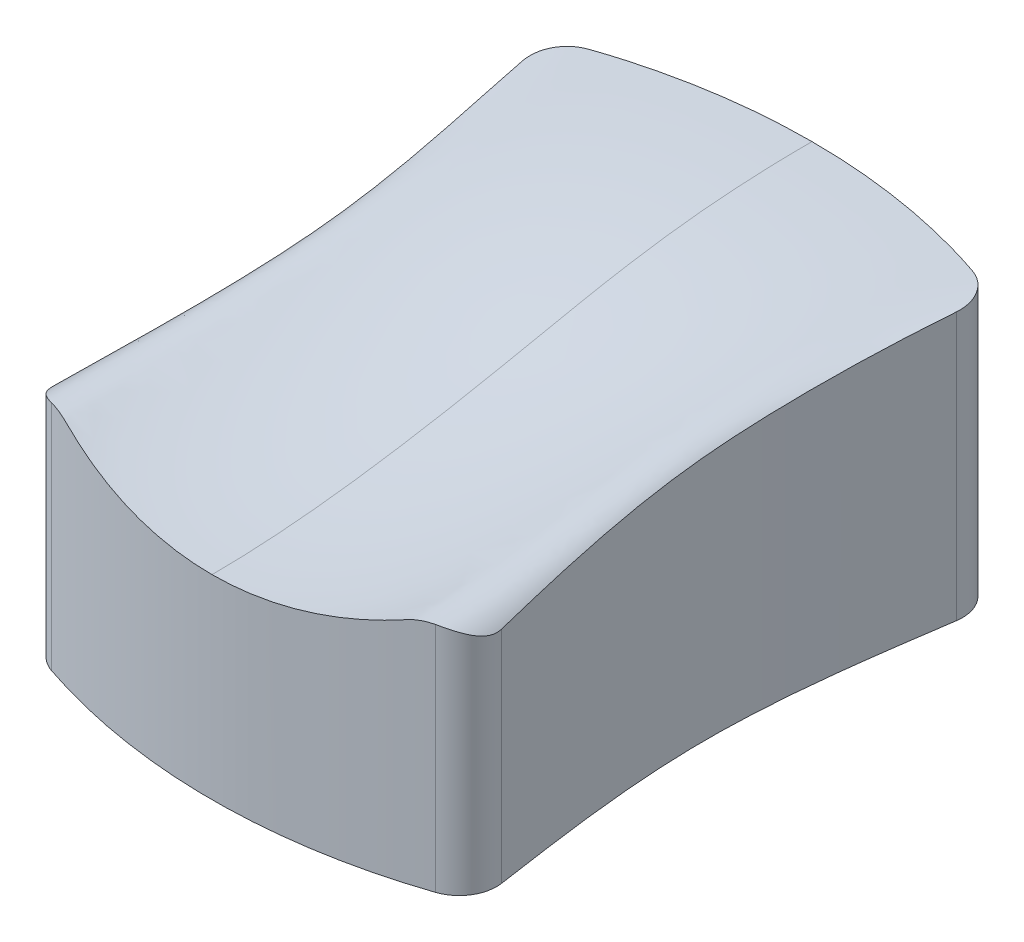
ISO-10303-21;
HEADER;
FILE_DESCRIPTION(('STEP AP214'),'2;1');
FILE_NAME('part.step','',(''),(''),'','','');
FILE_SCHEMA(('AUTOMOTIVE_DESIGN { 1 0 10303 214 1 1 1 1 }'));
ENDSEC;
DATA;
#1=APPLICATION_CONTEXT('core data for automotive mechanical design processes');
#2=APPLICATION_PROTOCOL_DEFINITION('international standard','automotive_design',2000,#1);
#3=PRODUCT_CONTEXT('',#1,'mechanical');
#4=PRODUCT('Part','Part','',(#3));
#5=PRODUCT_RELATED_PRODUCT_CATEGORY('part','',(#4));
#6=PRODUCT_DEFINITION_FORMATION('','',#4);
#7=PRODUCT_DEFINITION_CONTEXT('part definition',#1,'design');
#8=PRODUCT_DEFINITION('design','',#6,#7);
#9=PRODUCT_DEFINITION_SHAPE('','',#8);
#10=(LENGTH_UNIT() NAMED_UNIT(*) SI_UNIT(.MILLI.,.METRE.));
#11=(NAMED_UNIT(*) PLANE_ANGLE_UNIT() SI_UNIT($,.RADIAN.));
#12=(NAMED_UNIT(*) SI_UNIT($,.STERADIAN.) SOLID_ANGLE_UNIT());
#13=UNCERTAINTY_MEASURE_WITH_UNIT(LENGTH_MEASURE(1.E-05),#10,'distance_accuracy_value','');
#14=(GEOMETRIC_REPRESENTATION_CONTEXT(3) GLOBAL_UNCERTAINTY_ASSIGNED_CONTEXT((#13)) GLOBAL_UNIT_ASSIGNED_CONTEXT((#10,
#11,#12)) REPRESENTATION_CONTEXT('',''));
#15=CARTESIAN_POINT('',(0.,0.,0.));
#16=DIRECTION('',(0.,0.,1.));
#17=DIRECTION('',(1.,0.,0.));
#18=AXIS2_PLACEMENT_3D('',#15,#16,#17);
#19=CARTESIAN_POINT('',(150.,180.,2.27595720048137E-13));
#20=CARTESIAN_POINT('',(150.000000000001,180.,-33.3333333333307));
#21=CARTESIAN_POINT('',(109.999999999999,180.,-200.000000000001));
#22=CARTESIAN_POINT('',(150.,180.,-366.666666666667));
#23=CARTESIAN_POINT('',(150.,180.,-400.));
#24=B_SPLINE_CURVE_WITH_KNOTS('',3,(#19,#20,#21,#22,#23),.UNSPECIFIED.,.F.,.F.,(4,1,4),(0.,
0.500000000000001,1.),.UNSPECIFIED.);
#25=DIRECTION('',(0.,-1.,0.));
#26=VECTOR('',#25,1.);
#27=SURFACE_OF_LINEAR_EXTRUSION('',#24,#26);
#28=DIRECTION('',(0.,1.,0.));
#29=VECTOR('',#28,1.);
#30=CARTESIAN_POINT('',(144.787679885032,0.,-351.6653377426));
#31=LINE('',#30,#29);
#32=CARTESIAN_POINT('',(144.787679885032,0.,-351.6653377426));
#33=VERTEX_POINT('',#32);
#34=CARTESIAN_POINT('',(144.787679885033,178.308381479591,-351.6653377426));
#35=VERTEX_POINT('',#34);
#36=EDGE_CURVE('E357',#33,#35,#31,.T.);
#37=ORIENTED_EDGE('',*,*,#36,.T.);
#38=CARTESIAN_POINT('',(144.787679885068,178.308381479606,-351.665337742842));
#39=CARTESIAN_POINT('',(144.656074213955,178.250133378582,-350.760942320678));
#40=CARTESIAN_POINT('',(144.524104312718,178.190707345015,-349.856676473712));
#41=CARTESIAN_POINT('',(144.259654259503,178.069595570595,-348.048371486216));
#42=CARTESIAN_POINT('',(144.127174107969,178.007909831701,-347.144332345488));
#43=CARTESIAN_POINT('',(143.729300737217,177.819609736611,-344.432541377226));
#44=CARTESIAN_POINT('',(143.463469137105,177.689750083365,-342.625078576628));
#45=CARTESIAN_POINT('',(142.932124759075,177.422114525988,-339.010710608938));
#46=CARTESIAN_POINT('',(142.666611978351,177.284338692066,-337.203805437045));
#47=CARTESIAN_POINT('',(142.137162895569,177.001570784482,-333.590333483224));
#48=CARTESIAN_POINT('',(141.873226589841,176.856578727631,-331.783766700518));
#49=CARTESIAN_POINT('',(141.347654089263,176.559846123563,-328.168219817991));
#50=CARTESIAN_POINT('',(141.086021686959,176.408096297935,-326.359239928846));
#51=CARTESIAN_POINT('',(140.566409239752,176.098696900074,-322.741254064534));
#52=CARTESIAN_POINT('',(140.308429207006,175.941047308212,-320.932248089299));
#53=CARTESIAN_POINT('',(139.79699589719,175.620484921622,-317.314052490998));
#54=CARTESIAN_POINT('',(139.543542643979,175.457572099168,-315.504862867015));
#55=CARTESIAN_POINT('',(139.041959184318,175.127102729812,-311.8861562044));
#56=CARTESIAN_POINT('',(138.793829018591,174.959546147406,-310.076639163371));
#57=CARTESIAN_POINT('',(138.156206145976,174.518396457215,-305.36857280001));
#58=CARTESIAN_POINT('',(137.771460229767,174.241646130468,-302.469673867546));
#59=CARTESIAN_POINT('',(137.020326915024,173.680230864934,-296.670234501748));
#60=CARTESIAN_POINT('',(136.65393968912,173.395565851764,-293.769694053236));
#61=CARTESIAN_POINT('',(135.942118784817,172.820692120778,-287.966566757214));
#62=CARTESIAN_POINT('',(135.596685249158,172.530483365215,-285.063979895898));
#63=CARTESIAN_POINT('',(134.929250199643,171.946799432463,-279.256380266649));
#64=CARTESIAN_POINT('',(134.607249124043,171.653324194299,-276.351367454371));
#65=CARTESIAN_POINT('',(133.989099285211,171.065213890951,-270.538559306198));
#66=CARTESIAN_POINT('',(133.692951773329,170.770578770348,-267.630763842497));
#67=CARTESIAN_POINT('',(133.129300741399,170.182373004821,-261.815953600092));
#68=CARTESIAN_POINT('',(132.861762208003,169.888801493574,-258.90894231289));
#69=CARTESIAN_POINT('',(132.357358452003,169.303785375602,-253.091989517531));
#70=CARTESIAN_POINT('',(132.120493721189,169.012340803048,-250.182047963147));
#71=CARTESIAN_POINT('',(131.679971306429,168.432481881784,-244.359420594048));
#72=CARTESIAN_POINT('',(131.476312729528,168.144067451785,-241.446734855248));
#73=CARTESIAN_POINT('',(131.104822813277,167.570519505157,-235.618862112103));
#74=CARTESIAN_POINT('',(130.936990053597,167.285385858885,-232.703675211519));
#75=CARTESIAN_POINT('',(130.639888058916,166.71796605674,-226.871107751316));
#76=CARTESIAN_POINT('',(130.510618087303,166.435679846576,-223.953727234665));
#77=CARTESIAN_POINT('',(130.2950363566,165.876824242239,-218.157925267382));
#78=CARTESIAN_POINT('',(130.208150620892,165.600230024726,-215.279527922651));
#79=CARTESIAN_POINT('',(130.110245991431,165.185534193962,-210.961158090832));
#80=CARTESIAN_POINT('',(130.083014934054,165.047332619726,-209.521549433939));
#81=CARTESIAN_POINT('',(130.039740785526,164.770774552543,-206.642176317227));
#82=CARTESIAN_POINT('',(130.023697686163,164.632418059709,-205.202411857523));
#83=CARTESIAN_POINT('',(130.003214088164,164.355328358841,-202.322835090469));
#84=CARTESIAN_POINT('',(129.998773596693,164.216595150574,-200.883022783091));
#85=CARTESIAN_POINT('',(130.001820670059,163.938495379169,-198.00347188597));
#86=CARTESIAN_POINT('',(130.009308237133,163.799128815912,-196.563733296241));
#87=CARTESIAN_POINT('',(130.0357520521,163.519417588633,-193.684450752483));
#88=CARTESIAN_POINT('',(130.054708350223,163.37907292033,-192.244906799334));
#89=CARTESIAN_POINT('',(130.103710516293,163.097165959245,-189.366129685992));
#90=CARTESIAN_POINT('',(130.133756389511,162.955603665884,-187.926896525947));
#91=CARTESIAN_POINT('',(130.239945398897,162.528812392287,-183.609866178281));
#92=CARTESIAN_POINT('',(130.33214069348,162.241471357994,-180.732659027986));
#93=CARTESIAN_POINT('',(130.556572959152,161.659980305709,-174.976355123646));
#94=CARTESIAN_POINT('',(130.688867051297,161.365821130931,-172.097261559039));
#95=CARTESIAN_POINT('',(130.990681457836,160.770970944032,-166.341661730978));
#96=CARTESIAN_POINT('',(131.160202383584,160.470279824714,-163.465155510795));
#97=CARTESIAN_POINT('',(131.533841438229,159.862602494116,-157.714976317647));
#98=CARTESIAN_POINT('',(131.737960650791,159.555616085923,-154.841303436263));
#99=CARTESIAN_POINT('',(132.178276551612,158.935772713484,-149.097019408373));
#100=CARTESIAN_POINT('',(132.414473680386,158.62291566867,-146.226408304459));
#101=CARTESIAN_POINT('',(132.916503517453,157.991805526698,-140.488475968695));
#102=CARTESIAN_POINT('',(133.182335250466,157.673552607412,-137.621154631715));
#103=CARTESIAN_POINT('',(133.69742820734,157.082359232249,-132.339272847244));
#104=CARTESIAN_POINT('',(133.942747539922,156.810141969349,-129.924245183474));
#105=CARTESIAN_POINT('',(134.451351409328,156.262337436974,-125.096581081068));
#106=CARTESIAN_POINT('',(134.714635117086,155.986750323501,-122.683944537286));
#107=CARTESIAN_POINT('',(135.257763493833,155.432289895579,-117.860944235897));
#108=CARTESIAN_POINT('',(135.537607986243,155.153416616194,-115.450580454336));
#109=CARTESIAN_POINT('',(136.112431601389,154.59236840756,-110.632013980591));
#110=CARTESIAN_POINT('',(136.407410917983,154.310193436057,-108.223811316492));
#111=CARTESIAN_POINT('',(137.011032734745,153.742423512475,-103.409462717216));
#112=CARTESIAN_POINT('',(137.31967557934,153.456828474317,-101.003316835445));
#113=CARTESIAN_POINT('',(137.949081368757,152.88201511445,-96.192978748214));
#114=CARTESIAN_POINT('',(138.269844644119,152.592796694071,-93.7887865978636));
#115=CARTESIAN_POINT('',(138.92090171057,152.011278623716,-88.9891888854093));
#116=CARTESIAN_POINT('',(139.251165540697,151.718990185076,-86.5937778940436));
#117=CARTESIAN_POINT('',(139.920323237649,151.130138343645,-81.8046887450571));
#118=CARTESIAN_POINT('',(140.259217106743,150.833574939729,-79.4110105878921));
#119=CARTESIAN_POINT('',(140.943652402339,150.235739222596,-74.6252495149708));
#120=CARTESIAN_POINT('',(141.289193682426,149.934467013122,-72.2331665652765));
#121=CARTESIAN_POINT('',(141.984670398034,149.326764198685,-67.4504208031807));
#122=CARTESIAN_POINT('',(142.334605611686,149.020333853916,-65.0597579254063));
#123=CARTESIAN_POINT('',(142.860818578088,148.556537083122,-61.4745970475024));
#124=CARTESIAN_POINT('',(143.036433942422,148.401252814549,-60.2797318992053));
#125=CARTESIAN_POINT('',(143.387721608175,148.089270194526,-57.8901945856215));
#126=CARTESIAN_POINT('',(143.563393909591,147.932571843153,-56.6955224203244));
#127=CARTESIAN_POINT('',(143.914361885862,147.617769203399,-54.306455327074));
#128=CARTESIAN_POINT('',(144.089657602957,147.459665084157,-53.1120603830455));
#129=CARTESIAN_POINT('',(144.439414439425,147.142067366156,-50.7233327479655));
#130=CARTESIAN_POINT('',(144.613875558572,146.982573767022,-49.5290000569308));
#131=CARTESIAN_POINT('',(144.787679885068,146.82240287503,-48.3346622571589));
#132=B_SPLINE_CURVE_WITH_KNOTS('',3,(#38,#39,#40,#41,#42,#43,#44,#45,#46,#47,#48,#49,#50,#51,
#52,#53,#54,#55,#56,#57,#58,#59,#60,#61,#62,#63,#64,#65,#66,#67,#68,#69,#70,#71,#72,#73,#74,#75,
#76,#77,#78,#79,#80,#81,#82,#83,#84,#85,#86,#87,#88,#89,#90,#91,#92,#93,#94,#95,#96,#97,#98,#99,
#100,#101,#102,#103,#104,#105,#106,#107,#108,#109,#110,#111,#112,#113,#114,#115,#116,#117,#118,
#119,#120,#121,#122,#123,#124,#125,#126,#127,#128,#129,#130,#131),.UNSPECIFIED.,.F.,.F.,(4,2,2,
2,2,2,2,2,2,2,2,2,2,2,2,2,2,2,2,2,2,2,2,2,2,2,2,2,2,2,2,2,2,2,2,2,2,2,2,2,2,2,2,2,2,2,4),(0.,
2.74732319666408,5.49464401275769,10.989171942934,16.4836511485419,21.9781175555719,
27.4803756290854,32.9826520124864,38.484957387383,43.9873048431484,52.79939507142,
61.611568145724,70.4238012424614,79.2361991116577,88.0490232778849,96.8509352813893,
105.652988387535,114.45480475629,123.256272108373,132.057571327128,140.736122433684,
145.075537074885,149.414948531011,153.754362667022,158.093777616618,162.433211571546,
166.772647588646,175.451281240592,184.142336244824,192.833533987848,201.525004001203,
210.216593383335,218.907896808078,226.235838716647,233.56344266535,240.890968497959,
248.218588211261,255.546392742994,262.874397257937,270.181392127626,277.488388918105,
284.795224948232,292.101693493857,295.754624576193,299.407555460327,303.060052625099,
306.712550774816),.UNSPECIFIED.);
#133=CARTESIAN_POINT('',(144.787679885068,146.82240287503,-48.3346622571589));
#134=VERTEX_POINT('',#133);
#135=EDGE_CURVE('E321',#35,#134,#132,.T.);
#136=ORIENTED_EDGE('',*,*,#135,.T.);
#137=DIRECTION('',(0.,1.,0.));
#138=VECTOR('',#137,1.);
#139=CARTESIAN_POINT('',(144.787679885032,0.,-48.3346622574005));
#140=LINE('',#139,#138);
#141=CARTESIAN_POINT('',(144.787679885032,0.,-48.3346622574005));
#142=VERTEX_POINT('',#141);
#143=EDGE_CURVE('E367',#142,#134,#140,.T.);
#144=ORIENTED_EDGE('',*,*,#143,.F.);
#145=CARTESIAN_POINT('',(150.,0.,2.27595720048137E-13));
#146=CARTESIAN_POINT('',(150.000000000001,0.,-33.3333333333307));
#147=CARTESIAN_POINT('',(109.999999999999,0.,-200.000000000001));
#148=CARTESIAN_POINT('',(150.,0.,-366.666666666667));
#149=CARTESIAN_POINT('',(150.,0.,-400.));
#150=B_SPLINE_CURVE_WITH_KNOTS('',3,(#145,#146,#147,#148,#149),.UNSPECIFIED.,.F.,.F.,(4,1,4),
(0.,0.500000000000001,1.),.UNSPECIFIED.);
#151=EDGE_CURVE('E151',#142,#33,#150,.T.);
#152=ORIENTED_EDGE('',*,*,#151,.T.);
#153=EDGE_LOOP('',(#37,#136,#144,#152));
#154=FACE_BOUND('',#153,.T.);
#155=ADVANCED_FACE('F136',(#154),#27,.F.);
#156=CARTESIAN_POINT('',(130.,0.,-199.999999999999));
#157=DIRECTION('',(0.,1.,0.));
#158=DIRECTION('',(0.,0.,1.));
#159=AXIS2_PLACEMENT_3D('',#156,#157,#158);
#160=PLANE('',#159);
#161=CARTESIAN_POINT('',(0.,0.,-1.66533453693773E-13));
#162=DIRECTION('',(0.,-1.,0.));
#163=DIRECTION('',(0.,0.,1.));
#164=AXIS2_PLACEMENT_3D('',#161,#162,#163);
#165=CIRCLE('',#164,400.);
#166=CARTESIAN_POINT('',(-128.051445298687,0.,-378.949636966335));
#167=VERTEX_POINT('',#166);
#168=CARTESIAN_POINT('',(128.051445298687,0.,-378.949636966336));
#169=VERTEX_POINT('',#168);
#170=EDGE_CURVE('E354',#167,#169,#165,.T.);
#171=ORIENTED_EDGE('',*,*,#170,.T.);
#172=CARTESIAN_POINT('',(120.048229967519,0.,-355.265284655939));
#173=DIRECTION('',(0.,-1.,0.));
#174=DIRECTION('',(0.,0.,1.));
#175=AXIS2_PLACEMENT_3D('',#172,#173,#174);
#176=CIRCLE('',#175,25.0000000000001);
#177=EDGE_CURVE('E165',#169,#33,#176,.T.);
#178=ORIENTED_EDGE('',*,*,#177,.T.);
#179=ORIENTED_EDGE('',*,*,#151,.F.);
#180=CARTESIAN_POINT('',(120.048229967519,0.,-44.7347153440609));
#181=DIRECTION('',(0.,-1.,0.));
#182=DIRECTION('',(0.,0.,-1.));
#183=AXIS2_PLACEMENT_3D('',#180,#181,#182);
#184=CIRCLE('',#183,25.0000000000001);
#185=CARTESIAN_POINT('',(128.051445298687,0.,-21.0503630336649));
#186=VERTEX_POINT('',#185);
#187=EDGE_CURVE('E364',#142,#186,#184,.T.);
#188=ORIENTED_EDGE('',*,*,#187,.T.);
#189=CARTESIAN_POINT('',(0.,0.,-400.));
#190=DIRECTION('',(0.,-1.,0.));
#191=DIRECTION('',(0.,0.,-1.));
#192=AXIS2_PLACEMENT_3D('',#189,#190,#191);
#193=CIRCLE('',#192,400.);
#194=CARTESIAN_POINT('',(-128.051445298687,0.,-21.0503630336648));
#195=VERTEX_POINT('',#194);
#196=EDGE_CURVE('E360',#186,#195,#193,.T.);
#197=ORIENTED_EDGE('',*,*,#196,.T.);
#198=CARTESIAN_POINT('',(-120.048229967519,0.,-44.7347153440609));
#199=DIRECTION('',(0.,1.,0.));
#200=DIRECTION('',(0.,0.,-1.));
#201=AXIS2_PLACEMENT_3D('',#198,#199,#200);
#202=CIRCLE('',#201,25.0000000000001);
#203=CARTESIAN_POINT('',(-144.787679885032,0.,-48.3346622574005));
#204=VERTEX_POINT('',#203);
#205=EDGE_CURVE('E243',#204,#195,#202,.T.);
#206=ORIENTED_EDGE('',*,*,#205,.F.);
#207=CARTESIAN_POINT('',(-150.,0.,2.64333910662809E-13));
#208=CARTESIAN_POINT('',(-150.000000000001,0.,-33.3333333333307));
#209=CARTESIAN_POINT('',(-110.,0.,-200.));
#210=CARTESIAN_POINT('',(-150.,0.,-366.666666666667));
#211=CARTESIAN_POINT('',(-150.,0.,-400.));
#212=B_SPLINE_CURVE_WITH_KNOTS('',3,(#207,#208,#209,#210,#211),.UNSPECIFIED.,.F.,.F.,(4,1,4),
(0.,0.500000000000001,1.),.UNSPECIFIED.);
#213=CARTESIAN_POINT('',(-144.787679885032,0.,-351.6653377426));
#214=VERTEX_POINT('',#213);
#215=EDGE_CURVE('E253',#204,#214,#212,.T.);
#216=ORIENTED_EDGE('',*,*,#215,.T.);
#217=CARTESIAN_POINT('',(-120.048229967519,0.,-355.265284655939));
#218=DIRECTION('',(0.,1.,0.));
#219=DIRECTION('',(0.,0.,1.));
#220=AXIS2_PLACEMENT_3D('',#217,#218,#219);
#221=CIRCLE('',#220,25.0000000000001);
#222=EDGE_CURVE('E239',#167,#214,#221,.T.);
#223=ORIENTED_EDGE('',*,*,#222,.F.);
#224=EDGE_LOOP('',(#171,#178,#179,#188,#197,#206,#216,#223));
#225=FACE_BOUND('',#224,.T.);
#226=ADVANCED_FACE('F390',(#225),#160,.F.);
#227=CARTESIAN_POINT('',(0.,0.,-400.));
#228=DIRECTION('',(0.,1.,0.));
#229=DIRECTION('',(0.,0.,1.));
#230=AXIS2_PLACEMENT_3D('',#227,#228,#229);
#231=CYLINDRICAL_SURFACE('',#230,400.);
#232=DIRECTION('',(0.,1.,0.));
#233=VECTOR('',#232,1.);
#234=CARTESIAN_POINT('',(128.051445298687,0.,-21.0503630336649));
#235=LINE('',#234,#233);
#236=CARTESIAN_POINT('',(128.051445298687,154.678134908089,-21.0503630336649));
#237=VERTEX_POINT('',#236);
#238=EDGE_CURVE('E368',#186,#237,#235,.T.);
#239=ORIENTED_EDGE('',*,*,#238,.T.);
#240=CARTESIAN_POINT('',(128.051445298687,154.678134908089,-21.0503630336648));
#241=CARTESIAN_POINT('',(127.755067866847,154.708976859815,-20.9502132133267));
#242=CARTESIAN_POINT('',(127.458147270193,154.735254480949,-20.8502681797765));
#243=CARTESIAN_POINT('',(126.863899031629,154.778661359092,-20.6510193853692));
#244=CARTESIAN_POINT('',(126.566572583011,154.79580367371,-20.5517149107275));
#245=CARTESIAN_POINT('',(125.971677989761,154.820994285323,-20.3538034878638));
#246=CARTESIAN_POINT('',(125.674110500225,154.829052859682,-20.2551958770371));
#247=CARTESIAN_POINT('',(125.078899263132,154.836137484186,-20.0587320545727));
#248=CARTESIAN_POINT('',(124.781255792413,154.835171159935,-19.960875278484));
#249=CARTESIAN_POINT('',(124.186058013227,154.824246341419,-19.7659654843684));
#250=CARTESIAN_POINT('',(123.888503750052,154.814292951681,-19.6689120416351));
#251=CARTESIAN_POINT('',(123.293649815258,154.785419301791,-19.4756595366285));
#252=CARTESIAN_POINT('',(122.996350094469,154.766501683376,-19.379460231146));
#253=CARTESIAN_POINT('',(122.405380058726,154.71995898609,-19.1889992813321));
#254=CARTESIAN_POINT('',(122.111705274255,154.692430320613,-19.094727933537));
#255=CARTESIAN_POINT('',(121.525009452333,154.62860151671,-18.9071413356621));
#256=CARTESIAN_POINT('',(121.231988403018,154.592301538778,-18.8138260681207));
#257=CARTESIAN_POINT('',(120.646849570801,154.51091467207,-18.6282235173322));
#258=CARTESIAN_POINT('',(120.354731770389,154.465827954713,-18.5359362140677));
#259=CARTESIAN_POINT('',(119.771644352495,154.366840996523,-18.3524576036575));
#260=CARTESIAN_POINT('',(119.480674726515,154.312940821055,-18.2612662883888));
#261=CARTESIAN_POINT('',(119.045274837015,154.225521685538,-18.1253534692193));
#262=CARTESIAN_POINT('',(118.900314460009,154.195286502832,-18.0801940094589));
#263=CARTESIAN_POINT('',(118.610772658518,154.132632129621,-17.9901734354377));
#264=CARTESIAN_POINT('',(118.46619123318,154.100212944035,-17.9453123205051));
#265=CARTESIAN_POINT('',(118.177435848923,154.033196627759,-17.8558956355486));
#266=CARTESIAN_POINT('',(118.033261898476,153.998599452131,-17.81134007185));
#267=CARTESIAN_POINT('',(117.745352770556,153.927233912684,-17.7225423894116));
#268=CARTESIAN_POINT('',(117.601617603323,153.890465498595,-17.6783002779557));
#269=CARTESIAN_POINT('',(117.183562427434,153.780195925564,-17.5498788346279));
#270=CARTESIAN_POINT('',(116.909865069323,153.703814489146,-17.4661260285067));
#271=CARTESIAN_POINT('',(116.364395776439,153.543171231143,-17.2998449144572));
#272=CARTESIAN_POINT('',(116.092623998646,153.458908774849,-17.2173167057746));
#273=CARTESIAN_POINT('',(115.551170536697,153.282526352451,-17.0535193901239));
#274=CARTESIAN_POINT('',(115.281489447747,153.190404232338,-16.9722506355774));
#275=CARTESIAN_POINT('',(114.744528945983,152.998380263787,-16.8110496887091));
#276=CARTESIAN_POINT('',(114.477249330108,152.898479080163,-16.7311173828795));
#277=CARTESIAN_POINT('',(114.122440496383,152.760016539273,-16.625408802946));
#278=CARTESIAN_POINT('',(114.033736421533,152.724908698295,-16.5990147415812));
#279=CARTESIAN_POINT('',(113.856620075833,152.653851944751,-16.5463801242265));
#280=CARTESIAN_POINT('',(113.768207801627,152.617903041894,-16.520139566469));
#281=CARTESIAN_POINT('',(113.635844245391,152.563264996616,-16.4809039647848));
#282=CARTESIAN_POINT('',(113.591763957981,152.544932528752,-16.4678458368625));
#283=CARTESIAN_POINT('',(113.50359039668,152.508289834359,-16.4417422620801));
#284=CARTESIAN_POINT('',(113.459497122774,152.489979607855,-16.4286968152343));
#285=CARTESIAN_POINT('',(113.371298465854,152.453378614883,-16.4026188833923));
#286=CARTESIAN_POINT('',(113.327193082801,152.435087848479,-16.3895863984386));
#287=CARTESIAN_POINT('',(113.238970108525,152.398526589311,-16.3635343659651));
#288=CARTESIAN_POINT('',(113.194852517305,152.380256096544,-16.3505148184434));
#289=CARTESIAN_POINT('',(113.062479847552,152.32547408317,-16.3114751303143));
#290=CARTESIAN_POINT('',(112.97420654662,152.288992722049,-16.2854744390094));
#291=CARTESIAN_POINT('',(112.797611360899,152.216110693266,-16.2335249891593));
#292=CARTESIAN_POINT('',(112.709289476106,152.179710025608,-16.2075762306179));
#293=CARTESIAN_POINT('',(112.532603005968,152.106991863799,-16.1557324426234));
#294=CARTESIAN_POINT('',(112.444238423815,152.070674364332,-16.1298374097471));
#295=CARTESIAN_POINT('',(112.267460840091,151.998120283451,-16.0780994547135));
#296=CARTESIAN_POINT('',(112.179047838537,151.961883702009,-16.0522565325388));
#297=CARTESIAN_POINT('',(111.913740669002,151.853297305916,-15.9748073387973));
#298=CARTESIAN_POINT('',(111.73677388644,151.78106900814,-15.9232793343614));
#299=CARTESIAN_POINT('',(111.382648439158,151.636937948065,-15.8204331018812));
#300=CARTESIAN_POINT('',(111.205489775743,151.565035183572,-15.7691148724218));
#301=CARTESIAN_POINT('',(110.761751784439,151.385442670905,-15.6409084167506));
#302=CARTESIAN_POINT('',(110.495051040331,151.27795829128,-15.5641525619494));
#303=CARTESIAN_POINT('',(109.961214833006,151.063728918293,-15.4111177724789));
#304=CARTESIAN_POINT('',(109.69407936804,150.956983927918,-15.3348388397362));
#305=CARTESIAN_POINT('',(109.159364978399,150.744232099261,-15.1827572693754));
#306=CARTESIAN_POINT('',(108.891786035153,150.63822529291,-15.1069546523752));
#307=CARTESIAN_POINT('',(108.35619827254,150.426957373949,-14.9558314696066));
#308=CARTESIAN_POINT('',(108.088189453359,150.321696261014,-14.880510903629));
#309=CARTESIAN_POINT('',(107.282790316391,150.006749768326,-14.6550713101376));
#310=CARTESIAN_POINT('',(106.74475471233,149.798190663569,-14.5056812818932));
#311=CARTESIAN_POINT('',(105.666995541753,149.384098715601,-14.2088667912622));
#312=CARTESIAN_POINT('',(105.127272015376,149.178565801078,-14.0614422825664));
#313=CARTESIAN_POINT('',(104.045828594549,148.770420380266,-13.7684896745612));
#314=CARTESIAN_POINT('',(103.50410772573,148.567809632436,-13.6229627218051));
#315=CARTESIAN_POINT('',(102.418994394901,148.165643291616,-13.3339104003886));
#316=CARTESIAN_POINT('',(101.875601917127,147.966087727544,-13.190385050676));
#317=CARTESIAN_POINT('',(100.787292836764,147.57009095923,-12.9053889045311));
#318=CARTESIAN_POINT('',(100.242376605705,147.373649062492,-12.7639176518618));
#319=CARTESIAN_POINT('',(99.1509225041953,146.983843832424,-12.4830169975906));
#320=CARTESIAN_POINT('',(98.6043846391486,146.79048048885,-12.3435875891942));
#321=CARTESIAN_POINT('',(96.9515024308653,146.211231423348,-11.9256430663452));
#322=CARTESIAN_POINT('',(95.8426786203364,145.830113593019,-11.6502980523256));
#323=CARTESIAN_POINT('',(93.6187131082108,145.080680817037,-11.1081815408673));
#324=CARTESIAN_POINT('',(92.5035718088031,144.712365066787,-10.8414095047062));
#325=CARTESIAN_POINT('',(90.2671356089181,143.988635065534,-10.3165856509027));
#326=CARTESIAN_POINT('',(89.1458410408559,143.633220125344,-10.0585333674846));
#327=CARTESIAN_POINT('',(86.8972865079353,142.935336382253,-9.551296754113));
#328=CARTESIAN_POINT('',(85.7700267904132,142.592867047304,-9.30211205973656));
#329=CARTESIAN_POINT('',(83.5097206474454,141.920945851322,-8.8127511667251));
#330=CARTESIAN_POINT('',(82.3766743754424,141.591493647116,-8.57257473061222));
#331=CARTESIAN_POINT('',(80.1049351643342,140.945811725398,-8.10135870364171));
#332=CARTESIAN_POINT('',(78.9662422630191,140.629581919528,-7.87031905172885));
#333=CARTESIAN_POINT('',(76.795717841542,140.040962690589,-7.43979003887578));
#334=CARTESIAN_POINT('',(75.764397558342,139.767321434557,-7.23943329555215));
#335=CARTESIAN_POINT('',(73.6976961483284,139.231075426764,-6.84639674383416));
#336=CARTESIAN_POINT('',(72.6623160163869,138.968468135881,-6.65371516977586));
#337=CARTESIAN_POINT('',(70.5875900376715,138.454344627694,-6.27610726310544));
#338=CARTESIAN_POINT('',(69.5482448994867,138.202826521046,-6.09117960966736));
#339=CARTESIAN_POINT('',(67.4656875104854,137.71091678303,-5.72915665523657));
#340=CARTESIAN_POINT('',(66.422475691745,137.470523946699,-5.55206050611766));
#341=CARTESIAN_POINT('',(64.3322890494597,137.000878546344,-5.20577672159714));
#342=CARTESIAN_POINT('',(63.2853143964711,136.771625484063,-5.03658873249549));
#343=CARTESIAN_POINT('',(61.1877098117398,136.324259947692,-4.70619602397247));
#344=CARTESIAN_POINT('',(60.1370798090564,136.106147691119,-4.54499146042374));
#345=CARTESIAN_POINT('',(58.0311639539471,135.680794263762,-4.23047266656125));
#346=CARTESIAN_POINT('',(56.9758741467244,135.473565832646,-4.07716768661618));
#347=CARTESIAN_POINT('',(54.8618657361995,135.070304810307,-3.77870405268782));
#348=CARTESIAN_POINT('',(53.8031467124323,134.874273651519,-3.63354644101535));
#349=CARTESIAN_POINT('',(51.6824762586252,134.49355348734,-3.3514578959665));
#350=CARTESIAN_POINT('',(50.6205245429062,134.308865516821,-3.21452771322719));
#351=CARTESIAN_POINT('',(48.4935931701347,133.950936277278,-2.94897043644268));
#352=CARTESIAN_POINT('',(47.4286133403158,133.777695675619,-2.82034382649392));
#353=CARTESIAN_POINT('',(45.2958338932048,133.442746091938,-2.5714653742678));
#354=CARTESIAN_POINT('',(44.2280341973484,133.281037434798,-2.45121376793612));
#355=CARTESIAN_POINT('',(42.0898284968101,132.969210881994,-2.21915231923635));
#356=CARTESIAN_POINT('',(41.0194224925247,132.819092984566,-2.10734247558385));
#357=CARTESIAN_POINT('',(38.8449021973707,132.526265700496,-1.88908301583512));
#358=CARTESIAN_POINT('',(37.7407162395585,132.383900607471,-1.78288522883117));
#359=CARTESIAN_POINT('',(35.5300388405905,132.111494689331,-1.57955825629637));
#360=CARTESIAN_POINT('',(34.4235474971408,131.981453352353,-1.48242869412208));
#361=CARTESIAN_POINT('',(32.2084649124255,131.733678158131,-1.29729125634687));
#362=CARTESIAN_POINT('',(31.0998737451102,131.615943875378,-1.20928306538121));
#363=CARTESIAN_POINT('',(28.880800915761,131.39272943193,-1.04243666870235));
#364=CARTESIAN_POINT('',(27.7703193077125,131.287248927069,-0.963598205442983));
#365=CARTESIAN_POINT('',(25.5476607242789,131.088633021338,-0.815133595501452));
#366=CARTESIAN_POINT('',(24.4354837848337,130.995497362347,-0.745507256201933));
#367=CARTESIAN_POINT('',(22.2096323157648,130.821646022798,-0.615504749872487));
#368=CARTESIAN_POINT('',(21.0959578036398,130.740930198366,-0.555128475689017));
#369=CARTESIAN_POINT('',(18.8741982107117,130.592419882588,-0.44400376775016));
#370=CARTESIAN_POINT('',(17.7661211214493,130.524548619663,-0.393198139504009));
#371=CARTESIAN_POINT('',(15.5488862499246,130.401112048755,-0.300783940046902));
#372=CARTESIAN_POINT('',(14.4397284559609,130.345546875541,-0.259175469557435));
#373=CARTESIAN_POINT('',(12.2205276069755,130.24674864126,-0.185178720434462));
#374=CARTESIAN_POINT('',(11.1104845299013,130.20351589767,-0.15279067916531));
#375=CARTESIAN_POINT('',(8.88970825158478,130.12942706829,-0.0972532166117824));
#376=CARTESIAN_POINT('',(7.77897502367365,130.098571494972,-0.0741041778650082));
#377=CARTESIAN_POINT('',(5.55701562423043,130.049236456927,-0.0370589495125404));
#378=CARTESIAN_POINT('',(4.44578942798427,130.030757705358,-0.023163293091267));
#379=CARTESIAN_POINT('',(2.22304197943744,130.006135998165,-0.00463300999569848));
#380=CARTESIAN_POINT('',(1.11152071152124,129.999993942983,9.40677893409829E-07));
#381=CARTESIAN_POINT('',(-1.04091540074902E-13,130.,0.));
#382=B_SPLINE_CURVE_WITH_KNOTS('',3,(#240,#241,#242,#243,#244,#245,#246,#247,#248,#249,#250,
#251,#252,#253,#254,#255,#256,#257,#258,#259,#260,#261,#262,#263,#264,#265,#266,#267,#268,#269,
#270,#271,#272,#273,#274,#275,#276,#277,#278,#279,#280,#281,#282,#283,#284,#285,#286,#287,#288,
#289,#290,#291,#292,#293,#294,#295,#296,#297,#298,#299,#300,#301,#302,#303,#304,#305,#306,#307,
#308,#309,#310,#311,#312,#313,#314,#315,#316,#317,#318,#319,#320,#321,#322,#323,#324,#325,#326,
#327,#328,#329,#330,#331,#332,#333,#334,#335,#336,#337,#338,#339,#340,#341,#342,#343,#344,#345,
#346,#347,#348,#349,#350,#351,#352,#353,#354,#355,#356,#357,#358,#359,#360,#361,#362,#363,#364,
#365,#366,#367,#368,#369,#370,#371,#372,#373,#374,#375,#376,#377,#378,#379,#380,#381),
.UNSPECIFIED.,.F.,.F.,(4,2,2,2,2,2,2,2,2,2,2,2,2,2,2,2,2,2,2,2,2,2,2,2,2,2,2,2,2,2,2,2,2,2,2,2,
2,2,2,2,2,2,2,2,2,2,2,2,2,2,2,2,2,2,2,2,2,2,2,2,2,2,2,2,2,2,2,2,2,2,4),(0.,0.943038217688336,
1.8847248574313,2.82534499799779,3.76517043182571,4.70446239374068,5.64347772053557,
6.57233455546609,7.5011743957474,8.42999611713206,9.35881095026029,9.82323662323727,
10.287661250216,10.7520954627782,11.2165404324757,12.1051413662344,12.9938139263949,
13.8827308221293,14.7715718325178,15.0685182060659,15.3654611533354,15.5139432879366,
15.6624255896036,15.8109083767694,15.9593911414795,16.2563623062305,16.5533334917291,
16.8502851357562,17.1472366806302,17.7411248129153,18.3350089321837,19.2278469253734,
20.1206885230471,21.0135685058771,21.9064481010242,23.6946364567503,25.4827826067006,
27.2719633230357,29.0611609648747,30.8499549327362,32.6387429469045,36.2517890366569,
39.8646076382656,43.4772329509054,47.0897096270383,50.7020910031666,54.3144482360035,
57.5713207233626,60.8274395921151,64.083001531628,67.3382100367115,70.5932728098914,
73.8483991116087,77.1072543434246,80.3665255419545,83.6260936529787,86.8858516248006,
90.1457013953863,93.4055506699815,96.760581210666,100.115472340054,103.470247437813,
106.824928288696,110.179538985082,113.534110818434,116.867951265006,120.201828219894,
123.535790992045,126.869891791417,130.204184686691,133.538720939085),.UNSPECIFIED.);
#383=CARTESIAN_POINT('',(0.,130.,0.));
#384=VERTEX_POINT('',#383);
#385=EDGE_CURVE('E345',#237,#384,#382,.T.);
#386=ORIENTED_EDGE('',*,*,#385,.T.);
#387=CARTESIAN_POINT('',(-128.051445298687,154.678134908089,-21.0503630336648));
#388=CARTESIAN_POINT('',(-127.755067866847,154.708976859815,-20.9502132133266));
#389=CARTESIAN_POINT('',(-127.458147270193,154.735254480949,-20.8502681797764));
#390=CARTESIAN_POINT('',(-126.863899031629,154.778661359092,-20.6510193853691));
#391=CARTESIAN_POINT('',(-126.566572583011,154.79580367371,-20.5517149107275));
#392=CARTESIAN_POINT('',(-125.971677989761,154.820994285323,-20.3538034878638));
#393=CARTESIAN_POINT('',(-125.674110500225,154.829052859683,-20.2551958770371));
#394=CARTESIAN_POINT('',(-125.078899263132,154.836137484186,-20.0587320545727));
#395=CARTESIAN_POINT('',(-124.781255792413,154.835171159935,-19.960875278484));
#396=CARTESIAN_POINT('',(-124.186058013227,154.824246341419,-19.7659654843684));
#397=CARTESIAN_POINT('',(-123.888503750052,154.814292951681,-19.6689120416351));
#398=CARTESIAN_POINT('',(-123.293649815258,154.785419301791,-19.4756595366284));
#399=CARTESIAN_POINT('',(-122.996350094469,154.766501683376,-19.379460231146));
#400=CARTESIAN_POINT('',(-122.405380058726,154.71995898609,-19.1889992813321));
#401=CARTESIAN_POINT('',(-122.111705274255,154.692430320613,-19.0947279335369));
#402=CARTESIAN_POINT('',(-121.525009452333,154.62860151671,-18.907141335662));
#403=CARTESIAN_POINT('',(-121.231988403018,154.592301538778,-18.8138260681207));
#404=CARTESIAN_POINT('',(-120.646849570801,154.510914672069,-18.6282235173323));
#405=CARTESIAN_POINT('',(-120.354731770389,154.465827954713,-18.5359362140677));
#406=CARTESIAN_POINT('',(-119.771644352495,154.366840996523,-18.3524576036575));
#407=CARTESIAN_POINT('',(-119.480674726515,154.312940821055,-18.2612662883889));
#408=CARTESIAN_POINT('',(-119.045274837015,154.225521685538,-18.1253534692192));
#409=CARTESIAN_POINT('',(-118.900314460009,154.195286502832,-18.0801940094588));
#410=CARTESIAN_POINT('',(-118.610772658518,154.132632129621,-17.9901734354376));
#411=CARTESIAN_POINT('',(-118.46619123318,154.100212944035,-17.9453123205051));
#412=CARTESIAN_POINT('',(-118.177435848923,154.033196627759,-17.8558956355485));
#413=CARTESIAN_POINT('',(-118.033261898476,153.998599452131,-17.8113400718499));
#414=CARTESIAN_POINT('',(-117.745352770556,153.927233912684,-17.7225423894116));
#415=CARTESIAN_POINT('',(-117.601617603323,153.890465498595,-17.6783002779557));
#416=CARTESIAN_POINT('',(-117.183562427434,153.780195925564,-17.5498788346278));
#417=CARTESIAN_POINT('',(-116.909865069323,153.703814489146,-17.4661260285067));
#418=CARTESIAN_POINT('',(-116.36439577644,153.543171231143,-17.2998449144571));
#419=CARTESIAN_POINT('',(-116.092623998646,153.458908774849,-17.2173167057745));
#420=CARTESIAN_POINT('',(-115.551170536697,153.282526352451,-17.0535193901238));
#421=CARTESIAN_POINT('',(-115.281489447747,153.190404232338,-16.9722506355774));
#422=CARTESIAN_POINT('',(-114.744528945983,152.998380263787,-16.8110496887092));
#423=CARTESIAN_POINT('',(-114.477249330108,152.898479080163,-16.7311173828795));
#424=CARTESIAN_POINT('',(-114.122440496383,152.760016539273,-16.625408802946));
#425=CARTESIAN_POINT('',(-114.033736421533,152.724908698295,-16.5990147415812));
#426=CARTESIAN_POINT('',(-113.856620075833,152.653851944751,-16.5463801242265));
#427=CARTESIAN_POINT('',(-113.768207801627,152.617903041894,-16.5201395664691));
#428=CARTESIAN_POINT('',(-113.635844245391,152.563264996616,-16.4809039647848));
#429=CARTESIAN_POINT('',(-113.591763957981,152.544932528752,-16.4678458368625));
#430=CARTESIAN_POINT('',(-113.50359039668,152.508289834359,-16.4417422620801));
#431=CARTESIAN_POINT('',(-113.459497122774,152.489979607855,-16.4286968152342));
#432=CARTESIAN_POINT('',(-113.371298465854,152.453378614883,-16.4026188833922));
#433=CARTESIAN_POINT('',(-113.327193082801,152.435087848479,-16.3895863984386));
#434=CARTESIAN_POINT('',(-113.238970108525,152.398526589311,-16.3635343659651));
#435=CARTESIAN_POINT('',(-113.194852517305,152.380256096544,-16.3505148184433));
#436=CARTESIAN_POINT('',(-113.062479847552,152.32547408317,-16.3114751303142));
#437=CARTESIAN_POINT('',(-112.97420654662,152.28899272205,-16.2854744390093));
#438=CARTESIAN_POINT('',(-112.797611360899,152.216110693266,-16.2335249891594));
#439=CARTESIAN_POINT('',(-112.709289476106,152.179710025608,-16.2075762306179));
#440=CARTESIAN_POINT('',(-112.532603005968,152.106991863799,-16.1557324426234));
#441=CARTESIAN_POINT('',(-112.444238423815,152.070674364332,-16.1298374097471));
#442=CARTESIAN_POINT('',(-112.267460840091,151.998120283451,-16.0780994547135));
#443=CARTESIAN_POINT('',(-112.179047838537,151.961883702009,-16.0522565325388));
#444=CARTESIAN_POINT('',(-111.913740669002,151.853297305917,-15.9748073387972));
#445=CARTESIAN_POINT('',(-111.73677388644,151.78106900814,-15.9232793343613));
#446=CARTESIAN_POINT('',(-111.382648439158,151.636937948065,-15.8204331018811));
#447=CARTESIAN_POINT('',(-111.205489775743,151.565035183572,-15.7691148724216));
#448=CARTESIAN_POINT('',(-110.761751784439,151.385442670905,-15.6409084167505));
#449=CARTESIAN_POINT('',(-110.495051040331,151.27795829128,-15.5641525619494));
#450=CARTESIAN_POINT('',(-109.961214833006,151.063728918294,-15.4111177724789));
#451=CARTESIAN_POINT('',(-109.69407936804,150.956983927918,-15.3348388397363));
#452=CARTESIAN_POINT('',(-109.159364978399,150.744232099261,-15.1827572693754));
#453=CARTESIAN_POINT('',(-108.891786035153,150.63822529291,-15.1069546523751));
#454=CARTESIAN_POINT('',(-108.35619827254,150.426957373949,-14.9558314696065));
#455=CARTESIAN_POINT('',(-108.088189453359,150.321696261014,-14.880510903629));
#456=CARTESIAN_POINT('',(-107.282790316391,150.006749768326,-14.6550713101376));
#457=CARTESIAN_POINT('',(-106.74475471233,149.798190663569,-14.5056812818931));
#458=CARTESIAN_POINT('',(-105.666995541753,149.384098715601,-14.2088667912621));
#459=CARTESIAN_POINT('',(-105.127272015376,149.178565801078,-14.0614422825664));
#460=CARTESIAN_POINT('',(-104.045828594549,148.770420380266,-13.7684896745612));
#461=CARTESIAN_POINT('',(-103.50410772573,148.567809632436,-13.6229627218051));
#462=CARTESIAN_POINT('',(-102.418994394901,148.165643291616,-13.3339104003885));
#463=CARTESIAN_POINT('',(-101.875601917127,147.966087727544,-13.1903850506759));
#464=CARTESIAN_POINT('',(-100.787292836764,147.57009095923,-12.905388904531));
#465=CARTESIAN_POINT('',(-100.242376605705,147.373649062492,-12.7639176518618));
#466=CARTESIAN_POINT('',(-99.1509225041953,146.983843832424,-12.4830169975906));
#467=CARTESIAN_POINT('',(-98.6043846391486,146.79048048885,-12.3435875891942));
#468=CARTESIAN_POINT('',(-96.9515024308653,146.211231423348,-11.9256430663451));
#469=CARTESIAN_POINT('',(-95.8426786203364,145.830113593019,-11.6502980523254));
#470=CARTESIAN_POINT('',(-93.6187131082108,145.080680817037,-11.1081815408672));
#471=CARTESIAN_POINT('',(-92.503571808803,144.712365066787,-10.8414095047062));
#472=CARTESIAN_POINT('',(-90.2671356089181,143.988635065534,-10.3165856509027));
#473=CARTESIAN_POINT('',(-89.1458410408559,143.633220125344,-10.0585333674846));
#474=CARTESIAN_POINT('',(-86.8972865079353,142.935336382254,-9.55129675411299));
#475=CARTESIAN_POINT('',(-85.7700267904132,142.592867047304,-9.30211205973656));
#476=CARTESIAN_POINT('',(-83.5097206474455,141.920945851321,-8.81275116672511));
#477=CARTESIAN_POINT('',(-82.3766743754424,141.591493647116,-8.57257473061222));
#478=CARTESIAN_POINT('',(-80.1049351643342,140.945811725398,-8.10135870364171));
#479=CARTESIAN_POINT('',(-78.9662422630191,140.629581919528,-7.87031905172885));
#480=CARTESIAN_POINT('',(-76.795717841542,140.040962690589,-7.43979003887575));
#481=CARTESIAN_POINT('',(-75.764397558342,139.767321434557,-7.23943329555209));
#482=CARTESIAN_POINT('',(-73.6976961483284,139.231075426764,-6.84639674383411));
#483=CARTESIAN_POINT('',(-72.6623160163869,138.968468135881,-6.65371516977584));
#484=CARTESIAN_POINT('',(-70.5875900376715,138.454344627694,-6.27610726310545));
#485=CARTESIAN_POINT('',(-69.5482448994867,138.202826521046,-6.09117960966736));
#486=CARTESIAN_POINT('',(-67.4656875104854,137.71091678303,-5.72915665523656));
#487=CARTESIAN_POINT('',(-66.4224756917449,137.470523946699,-5.55206050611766));
#488=CARTESIAN_POINT('',(-64.3322890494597,137.000878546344,-5.20577672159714));
#489=CARTESIAN_POINT('',(-63.2853143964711,136.771625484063,-5.03658873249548));
#490=CARTESIAN_POINT('',(-61.1877098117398,136.324259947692,-4.70619602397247));
#491=CARTESIAN_POINT('',(-60.1370798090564,136.106147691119,-4.54499146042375));
#492=CARTESIAN_POINT('',(-58.0311639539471,135.680794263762,-4.23047266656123));
#493=CARTESIAN_POINT('',(-56.9758741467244,135.473565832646,-4.07716768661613));
#494=CARTESIAN_POINT('',(-54.8618657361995,135.070304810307,-3.77870405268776));
#495=CARTESIAN_POINT('',(-53.8031467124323,134.874273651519,-3.63354644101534));
#496=CARTESIAN_POINT('',(-51.6824762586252,134.49355348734,-3.35145789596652));
#497=CARTESIAN_POINT('',(-50.6205245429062,134.308865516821,-3.2145277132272));
#498=CARTESIAN_POINT('',(-48.4935931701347,133.950936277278,-2.94897043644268));
#499=CARTESIAN_POINT('',(-47.4286133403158,133.777695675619,-2.82034382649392));
#500=CARTESIAN_POINT('',(-45.2958338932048,133.442746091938,-2.5714653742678));
#501=CARTESIAN_POINT('',(-44.2280341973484,133.281037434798,-2.45121376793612));
#502=CARTESIAN_POINT('',(-42.0898284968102,132.969210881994,-2.21915231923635));
#503=CARTESIAN_POINT('',(-41.0194224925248,132.819092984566,-2.10734247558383));
#504=CARTESIAN_POINT('',(-38.8449021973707,132.526265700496,-1.88908301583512));
#505=CARTESIAN_POINT('',(-37.7407162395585,132.383900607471,-1.78288522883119));
#506=CARTESIAN_POINT('',(-35.5300388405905,132.111494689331,-1.57955825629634));
#507=CARTESIAN_POINT('',(-34.4235474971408,131.981453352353,-1.48242869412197));
#508=CARTESIAN_POINT('',(-32.2084649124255,131.733678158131,-1.29729125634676));
#509=CARTESIAN_POINT('',(-31.0998737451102,131.615943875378,-1.20928306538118));
#510=CARTESIAN_POINT('',(-28.880800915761,131.39272943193,-1.04243666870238));
#511=CARTESIAN_POINT('',(-27.7703193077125,131.287248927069,-0.963598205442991));
#512=CARTESIAN_POINT('',(-25.5476607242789,131.088633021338,-0.815133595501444));
#513=CARTESIAN_POINT('',(-24.4354837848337,130.995497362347,-0.745507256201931));
#514=CARTESIAN_POINT('',(-22.2096323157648,130.821646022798,-0.615504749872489));
#515=CARTESIAN_POINT('',(-21.0959578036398,130.740930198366,-0.555128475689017));
#516=CARTESIAN_POINT('',(-18.8741982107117,130.592419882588,-0.444003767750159));
#517=CARTESIAN_POINT('',(-17.7661211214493,130.524548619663,-0.393198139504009));
#518=CARTESIAN_POINT('',(-15.5488862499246,130.401112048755,-0.300783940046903));
#519=CARTESIAN_POINT('',(-14.4397284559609,130.345546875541,-0.259175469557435));
#520=CARTESIAN_POINT('',(-12.2205276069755,130.24674864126,-0.185178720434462));
#521=CARTESIAN_POINT('',(-11.1104845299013,130.20351589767,-0.15279067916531));
#522=CARTESIAN_POINT('',(-8.88970825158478,130.12942706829,-0.0972532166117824));
#523=CARTESIAN_POINT('',(-7.77897502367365,130.098571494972,-0.0741041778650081));
#524=CARTESIAN_POINT('',(-5.55701562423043,130.049236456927,-0.0370589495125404));
#525=CARTESIAN_POINT('',(-4.44578942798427,130.030757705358,-0.023163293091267));
#526=CARTESIAN_POINT('',(-2.22304197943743,130.006135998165,-0.00463300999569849));
#527=CARTESIAN_POINT('',(-1.11152071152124,129.999993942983,9.40677893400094E-07));
#528=CARTESIAN_POINT('',(1.04091540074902E-13,130.,0.));
#529=B_SPLINE_CURVE_WITH_KNOTS('',3,(#387,#388,#389,#390,#391,#392,#393,#394,#395,#396,#397,
#398,#399,#400,#401,#402,#403,#404,#405,#406,#407,#408,#409,#410,#411,#412,#413,#414,#415,#416,
#417,#418,#419,#420,#421,#422,#423,#424,#425,#426,#427,#428,#429,#430,#431,#432,#433,#434,#435,
#436,#437,#438,#439,#440,#441,#442,#443,#444,#445,#446,#447,#448,#449,#450,#451,#452,#453,#454,
#455,#456,#457,#458,#459,#460,#461,#462,#463,#464,#465,#466,#467,#468,#469,#470,#471,#472,#473,
#474,#475,#476,#477,#478,#479,#480,#481,#482,#483,#484,#485,#486,#487,#488,#489,#490,#491,#492,
#493,#494,#495,#496,#497,#498,#499,#500,#501,#502,#503,#504,#505,#506,#507,#508,#509,#510,#511,
#512,#513,#514,#515,#516,#517,#518,#519,#520,#521,#522,#523,#524,#525,#526,#527,#528),
.UNSPECIFIED.,.F.,.F.,(4,2,2,2,2,2,2,2,2,2,2,2,2,2,2,2,2,2,2,2,2,2,2,2,2,2,2,2,2,2,2,2,2,2,2,2,
2,2,2,2,2,2,2,2,2,2,2,2,2,2,2,2,2,2,2,2,2,2,2,2,2,2,2,2,2,2,2,2,2,2,4),(0.,0.943038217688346,
1.8847248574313,2.82534499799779,3.7651704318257,4.70446239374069,5.64347772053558,
6.57233455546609,7.50117439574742,8.42999611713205,9.3588109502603,9.82323662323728,
10.287661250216,10.7520954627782,11.2165404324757,12.1051413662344,12.9938139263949,
13.8827308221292,14.7715718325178,15.0685182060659,15.3654611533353,15.5139432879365,
15.6624255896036,15.8109083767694,15.9593911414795,16.2563623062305,16.5533334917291,
16.8502851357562,17.1472366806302,17.7411248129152,18.3350089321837,19.2278469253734,
20.1206885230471,21.0135685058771,21.9064481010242,23.6946364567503,25.4827826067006,
27.2719633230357,29.0611609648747,30.8499549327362,32.6387429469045,36.2517890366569,
39.8646076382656,43.4772329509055,47.0897096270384,50.7020910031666,54.3144482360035,
57.5713207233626,60.8274395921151,64.083001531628,67.3382100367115,70.5932728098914,
73.8483991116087,77.1072543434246,80.3665255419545,83.6260936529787,86.8858516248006,
90.1457013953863,93.4055506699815,96.760581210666,100.115472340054,103.470247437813,
106.824928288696,110.179538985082,113.534110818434,116.867951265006,120.201828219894,
123.535790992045,126.869891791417,130.204184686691,133.538720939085),.UNSPECIFIED.);
#530=CARTESIAN_POINT('',(-128.051445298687,154.678134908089,-21.0503630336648));
#531=VERTEX_POINT('',#530);
#532=EDGE_CURVE('E245',#531,#384,#529,.T.);
#533=ORIENTED_EDGE('',*,*,#532,.F.);
#534=DIRECTION('',(0.,1.,0.));
#535=VECTOR('',#534,1.);
#536=CARTESIAN_POINT('',(-128.051445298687,0.,-21.0503630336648));
#537=LINE('',#536,#535);
#538=EDGE_CURVE('E250',#195,#531,#537,.T.);
#539=ORIENTED_EDGE('',*,*,#538,.F.);
#540=ORIENTED_EDGE('',*,*,#196,.F.);
#541=EDGE_LOOP('',(#239,#386,#533,#539,#540));
#542=FACE_BOUND('',#541,.T.);
#543=ADVANCED_FACE('F336',(#542),#231,.T.);
#544=CARTESIAN_POINT('',(120.048229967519,0.,-44.7347153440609));
#545=DIRECTION('',(0.,1.,0.));
#546=DIRECTION('',(0.,0.,1.));
#547=AXIS2_PLACEMENT_3D('',#544,#545,#546);
#548=CYLINDRICAL_SURFACE('',#547,25.0000000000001);
#549=ORIENTED_EDGE('',*,*,#143,.T.);
#550=CARTESIAN_POINT('',(144.787679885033,146.822402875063,-48.3346622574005));
#551=CARTESIAN_POINT('',(144.813288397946,146.798801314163,-48.1586799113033));
#552=CARTESIAN_POINT('',(144.83705297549,146.777114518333,-47.9821825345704));
#553=CARTESIAN_POINT('',(144.880850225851,146.737643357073,-47.6282878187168));
#554=CARTESIAN_POINT('',(144.9008828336,146.719859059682,-47.4508904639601));
#555=CARTESIAN_POINT('',(144.955288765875,146.672493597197,-46.9178138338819));
#556=CARTESIAN_POINT('',(144.984007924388,146.648864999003,-46.5609912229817));
#557=CARTESIAN_POINT('',(145.026093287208,146.617786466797,-45.8458557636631));
#558=CARTESIAN_POINT('',(145.039463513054,146.610332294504,-45.487543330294));
#559=CARTESIAN_POINT('',(145.050710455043,146.61148076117,-44.7747135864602));
#560=CARTESIAN_POINT('',(145.048758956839,146.619904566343,-44.4201986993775));
#561=CARTESIAN_POINT('',(145.029822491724,146.652017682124,-43.7122469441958));
#562=CARTESIAN_POINT('',(145.012836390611,146.675708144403,-43.3588101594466));
#563=CARTESIAN_POINT('',(144.964016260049,146.737607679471,-42.6542608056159));
#564=CARTESIAN_POINT('',(144.932182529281,146.775816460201,-42.3031481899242));
#565=CARTESIAN_POINT('',(144.854053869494,146.865654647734,-41.6051571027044));
#566=CARTESIAN_POINT('',(144.807794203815,146.91725127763,-41.2582704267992));
#567=CARTESIAN_POINT('',(144.701149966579,147.032760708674,-40.5687521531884));
#568=CARTESIAN_POINT('',(144.640765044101,147.096673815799,-40.2261206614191));
#569=CARTESIAN_POINT('',(144.506274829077,147.235565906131,-39.545856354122));
#570=CARTESIAN_POINT('',(144.432169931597,147.310544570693,-39.2082233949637));
#571=CARTESIAN_POINT('',(144.270401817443,147.470530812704,-38.5374751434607));
#572=CARTESIAN_POINT('',(144.182697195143,147.555568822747,-38.204377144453));
#573=CARTESIAN_POINT('',(143.994305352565,147.734193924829,-37.5442145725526));
#574=CARTESIAN_POINT('',(143.893618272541,147.827780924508,-37.217149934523));
#575=CARTESIAN_POINT('',(143.679632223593,148.022259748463,-36.569348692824));
#576=CARTESIAN_POINT('',(143.566331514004,148.123152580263,-36.2486129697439));
#577=CARTESIAN_POINT('',(143.274773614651,148.376895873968,-35.4736902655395));
#578=CARTESIAN_POINT('',(143.08991022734,148.533032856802,-35.0230486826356));
#579=CARTESIAN_POINT('',(142.695573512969,148.854628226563,-34.1359634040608));
#580=CARTESIAN_POINT('',(142.486092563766,149.020089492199,-33.6995241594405));
#581=CARTESIAN_POINT('',(142.043244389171,149.35722881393,-32.8413339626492));
#582=CARTESIAN_POINT('',(141.809873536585,149.528907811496,-32.4195852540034));
#583=CARTESIAN_POINT('',(141.319448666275,149.875824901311,-31.5906081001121));
#584=CARTESIAN_POINT('',(141.062357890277,150.051068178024,-31.1834035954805));
#585=CARTESIAN_POINT('',(140.525302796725,150.402216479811,-30.3847679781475));
#586=CARTESIAN_POINT('',(140.245342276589,150.578121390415,-29.99333426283));
#587=CARTESIAN_POINT('',(139.66295828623,150.928314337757,-29.2268427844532));
#588=CARTESIAN_POINT('',(139.360535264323,151.102602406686,-28.8517846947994));
#589=CARTESIAN_POINT('',(138.570893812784,151.536808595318,-27.9285386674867));
#590=CARTESIAN_POINT('',(138.069193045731,151.794247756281,-27.3914646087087));
#591=CARTESIAN_POINT('',(137.016014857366,152.292738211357,-26.3597982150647));
#592=CARTESIAN_POINT('',(136.464528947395,152.533786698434,-25.8652131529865));
#593=CARTESIAN_POINT('',(135.60260231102,152.876703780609,-25.1592517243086));
#594=CARTESIAN_POINT('',(135.310049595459,152.98772311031,-24.9302847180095));
#595=CARTESIAN_POINT('',(134.713362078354,153.202717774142,-24.4844638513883));
#596=CARTESIAN_POINT('',(134.409226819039,153.306692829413,-24.2676104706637));
#597=CARTESIAN_POINT('',(133.480278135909,153.606521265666,-23.6363791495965));
#598=CARTESIAN_POINT('',(132.838392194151,153.790491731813,-23.2408949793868));
#599=CARTESIAN_POINT('',(131.850825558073,154.0360860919,-22.6929903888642));
#600=CARTESIAN_POINT('',(131.520365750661,154.112377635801,-22.5191741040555));
#601=CARTESIAN_POINT('',(130.850291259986,154.254837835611,-22.1857601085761));
#602=CARTESIAN_POINT('',(130.510679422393,154.321009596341,-22.0261580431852));
#603=CARTESIAN_POINT('',(129.822288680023,154.44257853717,-21.7214645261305));
#604=CARTESIAN_POINT('',(129.473492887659,154.497954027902,-21.5764025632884));
#605=CARTESIAN_POINT('',(128.768082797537,154.597017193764,-21.3016686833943));
#606=CARTESIAN_POINT('',(128.411465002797,154.640699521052,-21.1720038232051));
#607=CARTESIAN_POINT('',(128.051445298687,154.678134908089,-21.0503630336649));
#608=B_SPLINE_CURVE_WITH_KNOTS('',3,(#550,#551,#552,#553,#554,#555,#556,#557,#558,#559,#560,
#561,#562,#563,#564,#565,#566,#567,#568,#569,#570,#571,#572,#573,#574,#575,#576,#577,#578,#579,
#580,#581,#582,#583,#584,#585,#586,#587,#588,#589,#590,#591,#592,#593,#594,#595,#596,#597,#598,
#599,#600,#601,#602,#603,#604,#605,#606,#607),.UNSPECIFIED.,.F.,.F.,(4,2,2,2,2,2,2,2,2,2,2,2,2,
2,2,2,2,2,2,2,2,2,2,2,2,2,2,2,4),(0.,0.538144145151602,1.07629767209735,2.15181462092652,
3.2270497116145,4.29024673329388,5.35352396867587,6.41677981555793,7.47745670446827,
8.53815994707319,9.59883265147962,10.6628004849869,11.7267568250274,12.7908601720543,
14.3243783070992,15.8583725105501,17.392599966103,18.9292462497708,20.4656378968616,
22.0019988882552,24.335320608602,26.6690409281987,27.8318606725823,28.9947264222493,
31.3183122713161,32.4612195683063,33.6037755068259,34.7486036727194,35.8939545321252),.UNSPECIFIED.);
#609=EDGE_CURVE('E339',#134,#237,#608,.T.);
#610=ORIENTED_EDGE('',*,*,#609,.T.);
#611=ORIENTED_EDGE('',*,*,#238,.F.);
#612=ORIENTED_EDGE('',*,*,#187,.F.);
#613=EDGE_LOOP('',(#549,#610,#611,#612));
#614=FACE_BOUND('',#613,.T.);
#615=ADVANCED_FACE('F331',(#614),#548,.T.);
#616=CARTESIAN_POINT('',(120.048229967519,0.,-355.265284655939));
#617=DIRECTION('',(0.,1.,0.));
#618=DIRECTION('',(0.,0.,1.));
#619=AXIS2_PLACEMENT_3D('',#616,#617,#618);
#620=CYLINDRICAL_SURFACE('',#619,25.0000000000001);
#621=DIRECTION('',(0.,1.,0.));
#622=VECTOR('',#621,1.);
#623=CARTESIAN_POINT('',(128.051445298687,0.,-378.949636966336));
#624=LINE('',#623,#622);
#625=CARTESIAN_POINT('',(128.051445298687,179.866551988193,-378.949636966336));
#626=VERTEX_POINT('',#625);
#627=EDGE_CURVE('E358',#169,#626,#624,.T.);
#628=ORIENTED_EDGE('',*,*,#627,.T.);
#629=CARTESIAN_POINT('',(128.051445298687,179.866551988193,-378.949636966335));
#630=CARTESIAN_POINT('',(128.495209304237,179.861642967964,-378.799699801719));
#631=CARTESIAN_POINT('',(128.934743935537,179.856314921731,-378.637265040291));
#632=CARTESIAN_POINT('',(129.803969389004,179.844727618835,-378.287984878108));
#633=CARTESIAN_POINT('',(130.233660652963,179.83846840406,-378.101140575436));
#634=CARTESIAN_POINT('',(131.081847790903,179.824925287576,-377.703615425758));
#635=CARTESIAN_POINT('',(131.500343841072,179.817641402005,-377.492934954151));
#636=CARTESIAN_POINT('',(132.324562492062,179.801953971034,-377.04855154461));
#637=CARTESIAN_POINT('',(132.730293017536,179.793551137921,-376.814863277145));
#638=CARTESIAN_POINT('',(133.52797724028,179.775520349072,-376.325090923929));
#639=CARTESIAN_POINT('',(133.919931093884,179.765892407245,-376.06900709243));
#640=CARTESIAN_POINT('',(134.688802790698,179.745306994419,-375.535279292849));
#641=CARTESIAN_POINT('',(135.065720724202,179.734349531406,-375.257635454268));
#642=CARTESIAN_POINT('',(135.988008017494,179.705156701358,-374.537450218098));
#643=CARTESIAN_POINT('',(136.523281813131,179.686023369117,-374.081920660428));
#644=CARTESIAN_POINT('',(137.553592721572,179.644209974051,-373.127408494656));
#645=CARTESIAN_POINT('',(138.048624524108,179.621529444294,-372.628420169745));
#646=CARTESIAN_POINT('',(138.758137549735,179.584675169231,-371.850297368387));
#647=CARTESIAN_POINT('',(138.989131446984,179.571918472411,-371.585989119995));
#648=CARTESIAN_POINT('',(139.439704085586,179.545440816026,-371.047990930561));
#649=CARTESIAN_POINT('',(139.659286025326,179.531720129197,-370.77430365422));
#650=CARTESIAN_POINT('',(140.300456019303,179.489076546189,-369.939730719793));
#651=CARTESIAN_POINT('',(140.704510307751,179.458669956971,-369.365287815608));
#652=CARTESIAN_POINT('',(141.462622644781,179.393895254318,-368.184875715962));
#653=CARTESIAN_POINT('',(141.816695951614,179.359528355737,-367.578916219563));
#654=CARTESIAN_POINT('',(142.472600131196,179.28694893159,-366.339539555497));
#655=CARTESIAN_POINT('',(142.774430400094,179.248736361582,-365.706122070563));
#656=CARTESIAN_POINT('',(143.323933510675,179.16874746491,-364.415895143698));
#657=CARTESIAN_POINT('',(143.571566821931,179.126968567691,-363.759069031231));
#658=CARTESIAN_POINT('',(144.010692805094,179.040389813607,-362.42713273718));
#659=CARTESIAN_POINT('',(144.202187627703,178.995590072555,-361.752023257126));
#660=CARTESIAN_POINT('',(144.528225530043,178.903564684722,-360.386241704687));
#661=CARTESIAN_POINT('',(144.662599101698,178.85633227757,-359.695529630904));
#662=CARTESIAN_POINT('',(144.872677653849,178.760507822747,-358.305206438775));
#663=CARTESIAN_POINT('',(144.948372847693,178.71191554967,-357.605593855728));
#664=CARTESIAN_POINT('',(145.040450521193,178.614645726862,-356.20401079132));
#665=CARTESIAN_POINT('',(145.056957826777,178.565968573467,-355.502048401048));
#666=CARTESIAN_POINT('',(145.030869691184,178.469781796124,-354.099452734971));
#667=CARTESIAN_POINT('',(144.988312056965,178.422271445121,-353.398818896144));
#668=CARTESIAN_POINT('',(144.898557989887,178.364620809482,-352.528214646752));
#669=CARTESIAN_POINT('',(144.878896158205,178.353235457,-352.35524201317));
#670=CARTESIAN_POINT('',(144.835980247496,178.330659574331,-352.009879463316));
#671=CARTESIAN_POINT('',(144.812729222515,178.319468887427,-351.837489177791));
#672=CARTESIAN_POINT('',(144.787679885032,178.308381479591,-351.6653377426));
#673=B_SPLINE_CURVE_WITH_KNOTS('',3,(#629,#630,#631,#632,#633,#634,#635,#636,#637,#638,#639,
#640,#641,#642,#643,#644,#645,#646,#647,#648,#649,#650,#651,#652,#653,#654,#655,#656,#657,#658,
#659,#660,#661,#662,#663,#664,#665,#666,#667,#668,#669,#670,#671,#672),.UNSPECIFIED.,.F.,.F.,(4,
2,2,2,2,2,2,2,2,2,2,2,2,2,2,2,2,2,2,2,2,4),(0.,1.40511836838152,2.81017354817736,
4.21520660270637,5.61934949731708,7.02347645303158,8.42759497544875,10.5343905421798,
12.6414636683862,13.6949544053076,14.7481482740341,16.8543491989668,18.9599057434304,
21.0654866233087,23.1725982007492,25.27962904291,27.3928696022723,29.5064625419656,
31.6155953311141,33.7233787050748,34.2467320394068,34.7696424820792),.UNSPECIFIED.);
#674=EDGE_CURVE('E158',#626,#35,#673,.T.);
#675=ORIENTED_EDGE('',*,*,#674,.T.);
#676=ORIENTED_EDGE('',*,*,#36,.F.);
#677=ORIENTED_EDGE('',*,*,#177,.F.);
#678=EDGE_LOOP('',(#628,#675,#676,#677));
#679=FACE_BOUND('',#678,.T.);
#680=ADVANCED_FACE('F326',(#679),#620,.T.);
#681=CARTESIAN_POINT('',(0.,0.,-1.66533453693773E-13));
#682=DIRECTION('',(0.,1.,0.));
#683=DIRECTION('',(0.,0.,1.));
#684=AXIS2_PLACEMENT_3D('',#681,#682,#683);
#685=CYLINDRICAL_SURFACE('',#684,400.);
#686=ORIENTED_EDGE('',*,*,#170,.F.);
#687=DIRECTION('',(0.,1.,0.));
#688=VECTOR('',#687,1.);
#689=CARTESIAN_POINT('',(-128.051445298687,0.,-378.949636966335));
#690=LINE('',#689,#688);
#691=CARTESIAN_POINT('',(-128.051445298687,179.866551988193,-378.949636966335));
#692=VERTEX_POINT('',#691);
#693=EDGE_CURVE('E241',#167,#692,#690,.T.);
#694=ORIENTED_EDGE('',*,*,#693,.T.);
#695=CARTESIAN_POINT('',(0.,180.,-400.));
#696=CARTESIAN_POINT('',(-3.67245663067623,179.999983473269,-400.000013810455));
#697=CARTESIAN_POINT('',(-7.34491298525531,179.999999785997,-399.949424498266));
#698=CARTESIAN_POINT('',(-14.6870478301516,179.999975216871,-399.747138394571));
#699=CARTESIAN_POINT('',(-18.356726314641,179.999934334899,-399.595441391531));
#700=CARTESIAN_POINT('',(-25.6903669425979,179.99967250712,-399.191046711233));
#701=CARTESIAN_POINT('',(-29.3543293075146,179.999451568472,-398.938353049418));
#702=CARTESIAN_POINT('',(-36.6738983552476,179.998616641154,-398.332161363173));
#703=CARTESIAN_POINT('',(-40.3295050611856,179.998002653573,-397.97866361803));
#704=CARTESIAN_POINT('',(-47.5318204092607,179.996179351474,-397.181947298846));
#705=CARTESIAN_POINT('',(-51.0788232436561,179.994986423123,-396.741385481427));
#706=CARTESIAN_POINT('',(-58.159743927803,179.991840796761,-395.765356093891));
#707=CARTESIAN_POINT('',(-61.6936618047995,179.989888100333,-395.229888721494));
#708=CARTESIAN_POINT('',(-68.7458558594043,179.98515775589,-394.064436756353));
#709=CARTESIAN_POINT('',(-72.264132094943,179.982380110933,-393.434452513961));
#710=CARTESIAN_POINT('',(-79.2825659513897,179.976118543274,-392.080409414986));
#711=CARTESIAN_POINT('',(-82.7827235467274,179.972634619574,-391.356350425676));
#712=CARTESIAN_POINT('',(-88.6263285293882,179.966551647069,-390.065616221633));
#713=CARTESIAN_POINT('',(-90.9754327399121,179.964033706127,-389.524429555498));
#714=CARTESIAN_POINT('',(-94.4914493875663,179.960320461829,-388.680869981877));
#715=CARTESIAN_POINT('',(-95.6621877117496,179.959093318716,-388.394385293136));
#716=CARTESIAN_POINT('',(-98.0010307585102,179.95669534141,-387.81084389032));
#717=CARTESIAN_POINT('',(-99.1691354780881,179.955524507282,-387.513787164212));
#718=CARTESIAN_POINT('',(-101.502610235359,179.953280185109,-386.909127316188));
#719=CARTESIAN_POINT('',(-102.667980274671,179.952206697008,-386.601524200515));
#720=CARTESIAN_POINT('',(-104.995893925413,179.950201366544,-385.975795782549));
#721=CARTESIAN_POINT('',(-106.158437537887,179.949269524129,-385.657670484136));
#722=CARTESIAN_POINT('',(-107.900077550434,179.948024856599,-385.172606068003));
#723=CARTESIAN_POINT('',(-108.480272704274,179.947635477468,-385.009601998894));
#724=CARTESIAN_POINT('',(-109.639921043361,179.946903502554,-384.680972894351));
#725=CARTESIAN_POINT('',(-110.219374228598,179.946560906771,-384.515347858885));
#726=CARTESIAN_POINT('',(-111.087987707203,179.94612337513,-384.264947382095));
#727=CARTESIAN_POINT('',(-111.37743129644,179.945990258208,-384.181153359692));
#728=CARTESIAN_POINT('',(-111.956128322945,179.945652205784,-384.01291141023));
#729=CARTESIAN_POINT('',(-112.245381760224,179.945447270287,-383.928463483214));
#730=CARTESIAN_POINT('',(-113.112854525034,179.944708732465,-383.674139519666));
#731=CARTESIAN_POINT('',(-113.690786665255,179.944051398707,-383.503283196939));
#732=CARTESIAN_POINT('',(-114.845871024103,179.942342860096,-383.15896061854));
#733=CARTESIAN_POINT('',(-115.423023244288,179.94129165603,-382.985494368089));
#734=CARTESIAN_POINT('',(-116.576536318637,179.938725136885,-382.635955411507));
#735=CARTESIAN_POINT('',(-117.152897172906,179.937209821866,-382.459882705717));
#736=CARTESIAN_POINT('',(-118.880773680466,179.931859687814,-381.927760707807));
#737=CARTESIAN_POINT('',(-120.031087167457,179.927220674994,-381.567806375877));
#738=CARTESIAN_POINT('',(-122.328403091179,179.915226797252,-380.837517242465));
#739=CARTESIAN_POINT('',(-123.475405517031,179.907871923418,-380.467182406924));
#740=CARTESIAN_POINT('',(-125.76600737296,179.889847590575,-379.716162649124));
#741=CARTESIAN_POINT('',(-126.909606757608,179.879178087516,-379.335477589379));
#742=CARTESIAN_POINT('',(-128.051445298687,179.866551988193,-378.949636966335));
#743=B_SPLINE_CURVE_WITH_KNOTS('',3,(#695,#696,#697,#698,#699,#700,#701,#702,#703,#704,#705,
#706,#707,#708,#709,#710,#711,#712,#713,#714,#715,#716,#717,#718,#719,#720,#721,#722,#723,#724,
#725,#726,#727,#728,#729,#730,#731,#732,#733,#734,#735,#736,#737,#738,#739,#740,#741,#742),
.UNSPECIFIED.,.F.,.F.,(4,2,2,2,2,2,2,2,2,2,2,2,2,2,2,2,2,2,2,2,2,2,2,4),(0.,11.0170212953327,
22.0340656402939,33.0506720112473,44.0672478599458,54.7887475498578,65.5102249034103,
76.2316625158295,86.9531152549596,94.1846416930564,97.8004424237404,101.416247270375,
105.032049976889,108.64785135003,110.455821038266,112.263790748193,113.167776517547,
114.071762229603,115.879732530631,117.687699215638,119.495665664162,123.111586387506,
126.72751897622,130.343499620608),.UNSPECIFIED.);
#744=CARTESIAN_POINT('',(0.,180.,-400.));
#745=VERTEX_POINT('',#744);
#746=EDGE_CURVE('E221',#745,#692,#743,.T.);
#747=ORIENTED_EDGE('',*,*,#746,.F.);
#748=CARTESIAN_POINT('',(0.,180.,-400.));
#749=CARTESIAN_POINT('',(3.67245663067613,179.999983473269,-400.000013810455));
#750=CARTESIAN_POINT('',(7.34491298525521,179.999999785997,-399.949424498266));
#751=CARTESIAN_POINT('',(14.6870478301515,179.999975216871,-399.747138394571));
#752=CARTESIAN_POINT('',(18.3567263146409,179.999934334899,-399.595441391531));
#753=CARTESIAN_POINT('',(25.6903669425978,179.99967250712,-399.191046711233));
#754=CARTESIAN_POINT('',(29.3543293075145,179.999451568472,-398.938353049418));
#755=CARTESIAN_POINT('',(36.6738983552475,179.998616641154,-398.332161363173));
#756=CARTESIAN_POINT('',(40.3295050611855,179.998002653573,-397.97866361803));
#757=CARTESIAN_POINT('',(47.5318204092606,179.996179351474,-397.181947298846));
#758=CARTESIAN_POINT('',(51.078823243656,179.994986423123,-396.741385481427));
#759=CARTESIAN_POINT('',(58.1597439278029,179.991840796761,-395.765356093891));
#760=CARTESIAN_POINT('',(61.6936618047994,179.989888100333,-395.229888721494));
#761=CARTESIAN_POINT('',(68.7458558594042,179.98515775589,-394.064436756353));
#762=CARTESIAN_POINT('',(72.2641320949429,179.982380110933,-393.434452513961));
#763=CARTESIAN_POINT('',(79.2825659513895,179.976118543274,-392.080409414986));
#764=CARTESIAN_POINT('',(82.7827235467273,179.972634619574,-391.356350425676));
#765=CARTESIAN_POINT('',(88.6263285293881,179.966551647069,-390.065616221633));
#766=CARTESIAN_POINT('',(90.9754327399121,179.964033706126,-389.524429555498));
#767=CARTESIAN_POINT('',(94.4914493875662,179.960320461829,-388.680869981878));
#768=CARTESIAN_POINT('',(95.6621877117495,179.959093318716,-388.394385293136));
#769=CARTESIAN_POINT('',(98.0010307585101,179.95669534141,-387.81084389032));
#770=CARTESIAN_POINT('',(99.169135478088,179.955524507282,-387.513787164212));
#771=CARTESIAN_POINT('',(101.502610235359,179.953280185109,-386.909127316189));
#772=CARTESIAN_POINT('',(102.66798027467,179.952206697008,-386.601524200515));
#773=CARTESIAN_POINT('',(104.995893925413,179.950201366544,-385.975795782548));
#774=CARTESIAN_POINT('',(106.158437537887,179.949269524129,-385.657670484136));
#775=CARTESIAN_POINT('',(107.900077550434,179.948024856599,-385.172606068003));
#776=CARTESIAN_POINT('',(108.480272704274,179.947635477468,-385.009601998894));
#777=CARTESIAN_POINT('',(109.639921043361,179.946903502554,-384.680972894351));
#778=CARTESIAN_POINT('',(110.219374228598,179.946560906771,-384.515347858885));
#779=CARTESIAN_POINT('',(111.087987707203,179.94612337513,-384.264947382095));
#780=CARTESIAN_POINT('',(111.37743129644,179.945990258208,-384.181153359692));
#781=CARTESIAN_POINT('',(111.956128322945,179.945652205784,-384.01291141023));
#782=CARTESIAN_POINT('',(112.245381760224,179.945447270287,-383.928463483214));
#783=CARTESIAN_POINT('',(113.112854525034,179.944708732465,-383.674139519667));
#784=CARTESIAN_POINT('',(113.690786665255,179.944051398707,-383.503283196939));
#785=CARTESIAN_POINT('',(114.845871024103,179.942342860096,-383.15896061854));
#786=CARTESIAN_POINT('',(115.423023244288,179.94129165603,-382.985494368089));
#787=CARTESIAN_POINT('',(116.576536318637,179.938725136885,-382.635955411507));
#788=CARTESIAN_POINT('',(117.152897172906,179.937209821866,-382.459882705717));
#789=CARTESIAN_POINT('',(118.880773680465,179.931859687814,-381.927760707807));
#790=CARTESIAN_POINT('',(120.031087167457,179.927220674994,-381.567806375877));
#791=CARTESIAN_POINT('',(122.328403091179,179.915226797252,-380.837517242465));
#792=CARTESIAN_POINT('',(123.475405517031,179.907871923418,-380.467182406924));
#793=CARTESIAN_POINT('',(125.76600737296,179.889847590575,-379.716162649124));
#794=CARTESIAN_POINT('',(126.909606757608,179.879178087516,-379.335477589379));
#795=CARTESIAN_POINT('',(128.051445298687,179.866551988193,-378.949636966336));
#796=B_SPLINE_CURVE_WITH_KNOTS('',3,(#748,#749,#750,#751,#752,#753,#754,#755,#756,#757,#758,
#759,#760,#761,#762,#763,#764,#765,#766,#767,#768,#769,#770,#771,#772,#773,#774,#775,#776,#777,
#778,#779,#780,#781,#782,#783,#784,#785,#786,#787,#788,#789,#790,#791,#792,#793,#794,#795),
.UNSPECIFIED.,.F.,.F.,(4,2,2,2,2,2,2,2,2,2,2,2,2,2,2,2,2,2,2,2,2,2,2,4),(0.,11.0170212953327,
22.0340656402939,33.0506720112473,44.0672478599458,54.7887475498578,65.5102249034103,
76.2316625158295,86.9531152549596,94.1846416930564,97.8004424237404,101.416247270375,
105.032049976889,108.64785135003,110.455821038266,112.263790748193,113.167776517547,
114.071762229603,115.879732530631,117.687699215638,119.495665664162,123.111586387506,
126.72751897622,130.343499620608),.UNSPECIFIED.);
#797=EDGE_CURVE('E12',#745,#626,#796,.T.);
#798=ORIENTED_EDGE('',*,*,#797,.T.);
#799=ORIENTED_EDGE('',*,*,#627,.F.);
#800=EDGE_LOOP('',(#686,#694,#747,#798,#799));
#801=FACE_BOUND('',#800,.T.);
#802=ADVANCED_FACE('F330',(#801),#685,.T.);
#803=CARTESIAN_POINT('',(155.048229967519,124.610183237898,0.));
#804=CARTESIAN_POINT('',(155.048229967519,124.610183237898,-67.1710267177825));
#805=CARTESIAN_POINT('',(124.951761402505,135.987074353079,-210.690716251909));
#806=CARTESIAN_POINT('',(155.048229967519,180.,-311.709446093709));
#807=CARTESIAN_POINT('',(155.048229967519,180.,-400.));
#808=CARTESIAN_POINT('',(155.048229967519,126.811754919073,0.));
#809=CARTESIAN_POINT('',(155.048229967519,126.811754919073,-67.1609109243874));
#810=CARTESIAN_POINT('',(125.92391130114,138.787312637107,-210.600177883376));
#811=CARTESIAN_POINT('',(153.101846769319,180.,-311.90085434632));
#812=CARTESIAN_POINT('',(153.101846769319,180.,-400.));
#813=CARTESIAN_POINT('',(154.561601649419,131.36956602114,0.));
#814=CARTESIAN_POINT('',(154.561601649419,131.36956602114,-67.1406793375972));
#815=CARTESIAN_POINT('',(127.144790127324,144.212534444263,-210.41910114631));
#816=CARTESIAN_POINT('',(149.313193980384,180.,-312.283670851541));
#817=CARTESIAN_POINT('',(149.313193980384,180.,-400.));
#818=CARTESIAN_POINT('',(152.112443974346,138.255974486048,0.));
#819=CARTESIAN_POINT('',(152.112443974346,138.255974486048,-67.0822301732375));
#820=CARTESIAN_POINT('',(127.21251060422,151.520543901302,-210.268809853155));
#821=CARTESIAN_POINT('',(143.846224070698,180.,-312.643150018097));
#822=CARTESIAN_POINT('',(143.846224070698,180.,-400.));
#823=CARTESIAN_POINT('',(147.849624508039,144.615319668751,0.));
#824=CARTESIAN_POINT('',(147.849624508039,144.615319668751,-67.0112032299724));
#825=CARTESIAN_POINT('',(125.892188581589,157.841536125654,-210.178374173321));
#826=CARTESIAN_POINT('',(138.498931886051,180.,-312.895394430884));
#827=CARTESIAN_POINT('',(138.498931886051,180.,-400.));
#828=CARTESIAN_POINT('',(141.95654773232,149.804540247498,0.));
#829=CARTESIAN_POINT('',(141.95654773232,149.804540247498,-66.9415114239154));
#830=CARTESIAN_POINT('',(123.447470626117,163.108633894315,-210.134650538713));
#831=CARTESIAN_POINT('',(133.211478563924,180.,-313.052776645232));
#832=CARTESIAN_POINT('',(133.211478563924,180.,-400.));
#833=CARTESIAN_POINT('',(134.921232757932,153.291760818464,0.));
#834=CARTESIAN_POINT('',(134.921232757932,153.291760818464,-66.8905812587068));
#835=CARTESIAN_POINT('',(120.033883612,167.255381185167,-210.11369815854));
#836=CARTESIAN_POINT('',(127.924025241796,180.,-313.14576567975));
#837=CARTESIAN_POINT('',(127.924025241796,180.,-400.));
#838=CARTESIAN_POINT('',(127.420816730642,154.826902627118,0.));
#839=CARTESIAN_POINT('',(127.420816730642,154.826902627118,-66.8684630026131));
#840=CARTESIAN_POINT('',(115.754722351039,170.128588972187,-210.101867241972));
#841=CARTESIAN_POINT('',(122.576733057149,180.,-313.191618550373));
#842=CARTESIAN_POINT('',(122.576733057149,180.,-400.));
#843=CARTESIAN_POINT('',(120.119902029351,154.483916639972,0.));
#844=CARTESIAN_POINT('',(120.119902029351,154.483916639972,-66.8742002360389));
#845=CARTESIAN_POINT('',(110.763223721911,171.469486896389,-210.092257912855));
#846=CARTESIAN_POINT('',(117.109763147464,180.,-313.20510826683));
#847=CARTESIAN_POINT('',(117.109763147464,180.,-400.));
#848=CARTESIAN_POINT('',(115.717595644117,153.207144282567,0.));
#849=CARTESIAN_POINT('',(115.717595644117,153.207144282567,-66.8903884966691));
#850=CARTESIAN_POINT('',(107.16021042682,171.130529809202,-210.09149884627));
#851=CARTESIAN_POINT('',(113.321110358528,180.,-313.19040505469));
#852=CARTESIAN_POINT('',(113.321110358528,180.,-400.));
#853=CARTESIAN_POINT('',(108.955198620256,150.4381397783,0.));
#854=CARTESIAN_POINT('',(108.955198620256,150.4381397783,-66.9178185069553));
#855=CARTESIAN_POINT('',(101.205058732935,169.380765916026,-210.093366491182));
#856=CARTESIAN_POINT('',(106.860767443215,180.,-313.159176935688));
#857=CARTESIAN_POINT('',(106.860767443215,180.,-400.));
#858=CARTESIAN_POINT('',(99.5948034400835,146.885157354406,0.));
#859=CARTESIAN_POINT('',(99.5948034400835,146.885157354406,-66.9579792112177));
#860=CARTESIAN_POINT('',(92.7315182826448,167.021362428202,-210.106111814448));
#861=CARTESIAN_POINT('',(97.7418064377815,180.,-313.093412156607));
#862=CARTESIAN_POINT('',(97.7418064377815,180.,-400.));
#863=CARTESIAN_POINT('',(81.0689026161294,140.880166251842,0.));
#864=CARTESIAN_POINT('',(81.0689026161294,140.880166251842,-67.030696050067));
#865=CARTESIAN_POINT('',(75.3292468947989,162.777840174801,-210.130413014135));
#866=CARTESIAN_POINT('',(79.2202294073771,180.,-312.971884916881));
#867=CARTESIAN_POINT('',(79.2202294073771,180.,-400.));
#868=CARTESIAN_POINT('',(58.0161090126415,135.210982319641,0.));
#869=CARTESIAN_POINT('',(58.0161090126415,135.210982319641,-67.1079477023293));
#870=CARTESIAN_POINT('',(52.9834014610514,158.571183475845,-210.16911223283));
#871=CARTESIAN_POINT('',(55.687363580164,180.,-312.816986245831));
#872=CARTESIAN_POINT('',(55.687363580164,180.,-400.000000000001));
#873=CARTESIAN_POINT('',(34.5342610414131,131.72189142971,0.));
#874=CARTESIAN_POINT('',(34.5342610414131,131.72189142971,-67.1597123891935));
#875=CARTESIAN_POINT('',(30.5045981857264,156.103012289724,-210.196141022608));
#876=CARTESIAN_POINT('',(32.1544977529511,180.,-312.710995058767));
#877=CARTESIAN_POINT('',(32.1544977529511,180.,-400.));
#878=CARTESIAN_POINT('',(15.11445811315,130.258958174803,0.));
#879=CARTESIAN_POINT('',(15.11445811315,130.258958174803,-67.1824244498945));
#880=CARTESIAN_POINT('',(12.8634783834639,155.170953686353,-210.207598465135));
#881=CARTESIAN_POINT('',(13.6329207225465,180.,-312.665294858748));
#882=CARTESIAN_POINT('',(13.6329207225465,180.,-400.));
#883=CARTESIAN_POINT('',(5.10578074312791,130.,0.));
#884=CARTESIAN_POINT('',(5.10578074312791,130.,-67.184462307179));
#885=CARTESIAN_POINT('',(4.2396160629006,155.026774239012,-210.208716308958));
#886=CARTESIAN_POINT('',(4.51395971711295,180.,-312.661014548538));
#887=CARTESIAN_POINT('',(4.51395971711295,180.,-400.));
#888=CARTESIAN_POINT('',(-1.04091540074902E-13,130.,0.));
#889=CARTESIAN_POINT('',(-1.04091540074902E-13,130.,-67.1854812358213));
#890=CARTESIAN_POINT('',(-2.093539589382E-13,155.026774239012,-210.20927523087));
#891=CARTESIAN_POINT('',(0.,180.,-312.658874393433));
#892=CARTESIAN_POINT('',(0.,180.,-400.));
#893=B_SPLINE_SURFACE_WITH_KNOTS('',3,3,((#803,#804,#805,#806,#807),(#808,#809,#810,#811,#812),
(#813,#814,#815,#816,#817),(#818,#819,#820,#821,#822),(#823,#824,#825,#826,#827),(#828,#829,
#830,#831,#832),(#833,#834,#835,#836,#837),(#838,#839,#840,#841,#842),(#843,#844,#845,#846,
#847),(#848,#849,#850,#851,#852),(#853,#854,#855,#856,#857),(#858,#859,#860,#861,#862),(#863,
#864,#865,#866,#867),(#868,#869,#870,#871,#872),(#873,#874,#875,#876,#877),(#878,#879,#880,#881,
#882),(#883,#884,#885,#886,#887),(#888,#889,#890,#891,#892)),.UNSPECIFIED.,.F.,.F.,.F.,(4,1,1,1,
1,1,1,1,2,1,1,1,1,1,4),(4,1,4),(0.,0.0376602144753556,0.0753204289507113,0.112980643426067,
0.150640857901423,0.188301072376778,0.225961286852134,0.263621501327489,0.301281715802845,
0.388621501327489,0.475961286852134,0.650640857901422,0.825320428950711,0.912660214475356,1.),
(0.,0.499732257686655,1.),.UNSPECIFIED.);
#894=CARTESIAN_POINT('',(1.04091540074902E-13,130.,0.));
#895=CARTESIAN_POINT('',(0.,130.,-67.1854812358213));
#896=CARTESIAN_POINT('',(1.57869236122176E-13,155.026774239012,-210.20927523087));
#897=CARTESIAN_POINT('',(0.,180.,-312.658874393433));
#898=CARTESIAN_POINT('',(0.,180.,-400.));
#899=B_SPLINE_CURVE_WITH_KNOTS('',3,(#894,#895,#896,#897,#898),.UNSPECIFIED.,.F.,.F.,(4,1,4),
(0.,0.499732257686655,1.),.UNSPECIFIED.);
#900=EDGE_CURVE('E226',#384,#745,#899,.T.);
#901=ORIENTED_EDGE('',*,*,#609,.F.);
#902=ORIENTED_EDGE('',*,*,#135,.F.);
#903=ORIENTED_EDGE('',*,*,#674,.F.);
#904=ORIENTED_EDGE('',*,*,#797,.F.);
#905=ORIENTED_EDGE('',*,*,#900,.F.);
#906=ORIENTED_EDGE('',*,*,#385,.F.);
#907=EDGE_LOOP('',(#901,#902,#903,#904,#905,#906));
#908=FACE_BOUND('',#907,.T.);
#909=ADVANCED_FACE('F270',(#908),#893,.F.);
#910=CARTESIAN_POINT('',(-150.,180.,2.64333910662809E-13));
#911=CARTESIAN_POINT('',(-150.000000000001,180.,-33.3333333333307));
#912=CARTESIAN_POINT('',(-110.,180.,-200.));
#913=CARTESIAN_POINT('',(-150.,180.,-366.666666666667));
#914=CARTESIAN_POINT('',(-150.,180.,-400.));
#915=B_SPLINE_CURVE_WITH_KNOTS('',3,(#910,#911,#912,#913,#914),.UNSPECIFIED.,.F.,.F.,(4,1,4),
(0.,0.500000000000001,1.),.UNSPECIFIED.);
#916=DIRECTION('',(0.,-1.,0.));
#917=VECTOR('',#916,1.);
#918=SURFACE_OF_LINEAR_EXTRUSION('',#915,#917);
#919=DIRECTION('',(0.,1.,0.));
#920=VECTOR('',#919,1.);
#921=CARTESIAN_POINT('',(-144.787679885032,0.,-351.6653377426));
#922=LINE('',#921,#920);
#923=CARTESIAN_POINT('',(-144.787679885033,178.308381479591,-351.6653377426));
#924=VERTEX_POINT('',#923);
#925=EDGE_CURVE('E232',#214,#924,#922,.T.);
#926=ORIENTED_EDGE('',*,*,#925,.F.);
#927=ORIENTED_EDGE('',*,*,#215,.F.);
#928=DIRECTION('',(0.,1.,0.));
#929=VECTOR('',#928,1.);
#930=CARTESIAN_POINT('',(-144.787679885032,0.,-48.3346622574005));
#931=LINE('',#930,#929);
#932=CARTESIAN_POINT('',(-144.787679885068,146.82240287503,-48.3346622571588));
#933=VERTEX_POINT('',#932);
#934=EDGE_CURVE('E234',#204,#933,#931,.T.);
#935=ORIENTED_EDGE('',*,*,#934,.T.);
#936=CARTESIAN_POINT('',(-144.787679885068,178.308381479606,-351.665337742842));
#937=CARTESIAN_POINT('',(-144.656074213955,178.250133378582,-350.760942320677));
#938=CARTESIAN_POINT('',(-144.524104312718,178.190707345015,-349.856676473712));
#939=CARTESIAN_POINT('',(-144.259654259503,178.069595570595,-348.048371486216));
#940=CARTESIAN_POINT('',(-144.127174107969,178.007909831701,-347.144332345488));
#941=CARTESIAN_POINT('',(-143.729300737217,177.819609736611,-344.432541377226));
#942=CARTESIAN_POINT('',(-143.463469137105,177.689750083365,-342.625078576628));
#943=CARTESIAN_POINT('',(-142.932124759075,177.422114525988,-339.010710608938));
#944=CARTESIAN_POINT('',(-142.666611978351,177.284338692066,-337.203805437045));
#945=CARTESIAN_POINT('',(-142.137162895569,177.001570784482,-333.590333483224));
#946=CARTESIAN_POINT('',(-141.873226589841,176.856578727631,-331.783766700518));
#947=CARTESIAN_POINT('',(-141.347654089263,176.559846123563,-328.168219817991));
#948=CARTESIAN_POINT('',(-141.086021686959,176.408096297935,-326.359239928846));
#949=CARTESIAN_POINT('',(-140.566409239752,176.098696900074,-322.741254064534));
#950=CARTESIAN_POINT('',(-140.308429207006,175.941047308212,-320.932248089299));
#951=CARTESIAN_POINT('',(-139.79699589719,175.620484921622,-317.314052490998));
#952=CARTESIAN_POINT('',(-139.543542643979,175.457572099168,-315.504862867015));
#953=CARTESIAN_POINT('',(-139.041959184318,175.127102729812,-311.8861562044));
#954=CARTESIAN_POINT('',(-138.793829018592,174.959546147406,-310.076639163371));
#955=CARTESIAN_POINT('',(-138.156206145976,174.518396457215,-305.36857280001));
#956=CARTESIAN_POINT('',(-137.771460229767,174.241646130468,-302.469673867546));
#957=CARTESIAN_POINT('',(-137.020326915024,173.680230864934,-296.670234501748));
#958=CARTESIAN_POINT('',(-136.65393968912,173.395565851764,-293.769694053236));
#959=CARTESIAN_POINT('',(-135.942118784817,172.820692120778,-287.966566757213));
#960=CARTESIAN_POINT('',(-135.596685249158,172.530483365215,-285.063979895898));
#961=CARTESIAN_POINT('',(-134.929250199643,171.946799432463,-279.256380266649));
#962=CARTESIAN_POINT('',(-134.607249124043,171.653324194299,-276.351367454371));
#963=CARTESIAN_POINT('',(-133.989099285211,171.065213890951,-270.538559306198));
#964=CARTESIAN_POINT('',(-133.692951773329,170.770578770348,-267.630763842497));
#965=CARTESIAN_POINT('',(-133.129300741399,170.182373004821,-261.815953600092));
#966=CARTESIAN_POINT('',(-132.861762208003,169.888801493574,-258.90894231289));
#967=CARTESIAN_POINT('',(-132.357358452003,169.303785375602,-253.091989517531));
#968=CARTESIAN_POINT('',(-132.120493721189,169.012340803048,-250.182047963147));
#969=CARTESIAN_POINT('',(-131.679971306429,168.432481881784,-244.359420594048));
#970=CARTESIAN_POINT('',(-131.476312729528,168.144067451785,-241.446734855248));
#971=CARTESIAN_POINT('',(-131.104822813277,167.570519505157,-235.618862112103));
#972=CARTESIAN_POINT('',(-130.936990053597,167.285385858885,-232.703675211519));
#973=CARTESIAN_POINT('',(-130.639888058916,166.71796605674,-226.871107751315));
#974=CARTESIAN_POINT('',(-130.510618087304,166.435679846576,-223.953727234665));
#975=CARTESIAN_POINT('',(-130.2950363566,165.876824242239,-218.157925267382));
#976=CARTESIAN_POINT('',(-130.208150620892,165.600230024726,-215.279527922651));
#977=CARTESIAN_POINT('',(-130.110245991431,165.185534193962,-210.961158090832));
#978=CARTESIAN_POINT('',(-130.083014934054,165.047332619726,-209.521549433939));
#979=CARTESIAN_POINT('',(-130.039740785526,164.770774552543,-206.642176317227));
#980=CARTESIAN_POINT('',(-130.023697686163,164.632418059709,-205.202411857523));
#981=CARTESIAN_POINT('',(-130.003214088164,164.355328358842,-202.322835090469));
#982=CARTESIAN_POINT('',(-129.998773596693,164.216595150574,-200.883022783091));
#983=CARTESIAN_POINT('',(-130.001820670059,163.938495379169,-198.00347188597));
#984=CARTESIAN_POINT('',(-130.009308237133,163.799128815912,-196.563733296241));
#985=CARTESIAN_POINT('',(-130.0357520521,163.519417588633,-193.684450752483));
#986=CARTESIAN_POINT('',(-130.054708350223,163.37907292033,-192.244906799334));
#987=CARTESIAN_POINT('',(-130.103710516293,163.097165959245,-189.366129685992));
#988=CARTESIAN_POINT('',(-130.133756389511,162.955603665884,-187.926896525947));
#989=CARTESIAN_POINT('',(-130.239945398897,162.528812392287,-183.609866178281));
#990=CARTESIAN_POINT('',(-130.33214069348,162.241471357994,-180.732659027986));
#991=CARTESIAN_POINT('',(-130.556572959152,161.659980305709,-174.976355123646));
#992=CARTESIAN_POINT('',(-130.688867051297,161.365821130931,-172.097261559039));
#993=CARTESIAN_POINT('',(-130.990681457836,160.770970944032,-166.341661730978));
#994=CARTESIAN_POINT('',(-131.160202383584,160.470279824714,-163.465155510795));
#995=CARTESIAN_POINT('',(-131.533841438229,159.862602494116,-157.714976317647));
#996=CARTESIAN_POINT('',(-131.737960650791,159.555616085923,-154.841303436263));
#997=CARTESIAN_POINT('',(-132.178276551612,158.935772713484,-149.097019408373));
#998=CARTESIAN_POINT('',(-132.414473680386,158.622915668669,-146.226408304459));
#999=CARTESIAN_POINT('',(-132.916503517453,157.991805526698,-140.488475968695));
#1000=CARTESIAN_POINT('',(-133.182335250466,157.673552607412,-137.621154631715));
#1001=CARTESIAN_POINT('',(-133.69742820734,157.082359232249,-132.339272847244));
#1002=CARTESIAN_POINT('',(-133.942747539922,156.810141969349,-129.924245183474));
#1003=CARTESIAN_POINT('',(-134.451351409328,156.262337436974,-125.096581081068));
#1004=CARTESIAN_POINT('',(-134.714635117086,155.986750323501,-122.683944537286));
#1005=CARTESIAN_POINT('',(-135.257763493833,155.432289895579,-117.860944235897));
#1006=CARTESIAN_POINT('',(-135.537607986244,155.153416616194,-115.450580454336));
#1007=CARTESIAN_POINT('',(-136.112431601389,154.59236840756,-110.632013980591));
#1008=CARTESIAN_POINT('',(-136.407410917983,154.310193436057,-108.223811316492));
#1009=CARTESIAN_POINT('',(-137.011032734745,153.742423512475,-103.409462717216));
#1010=CARTESIAN_POINT('',(-137.31967557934,153.456828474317,-101.003316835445));
#1011=CARTESIAN_POINT('',(-137.949081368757,152.88201511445,-96.192978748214));
#1012=CARTESIAN_POINT('',(-138.269844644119,152.592796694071,-93.7887865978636));
#1013=CARTESIAN_POINT('',(-138.92090171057,152.011278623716,-88.9891888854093));
#1014=CARTESIAN_POINT('',(-139.251165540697,151.718990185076,-86.5937778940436));
#1015=CARTESIAN_POINT('',(-139.920323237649,151.130138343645,-81.8046887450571));
#1016=CARTESIAN_POINT('',(-140.259217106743,150.833574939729,-79.4110105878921));
#1017=CARTESIAN_POINT('',(-140.943652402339,150.235739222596,-74.6252495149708));
#1018=CARTESIAN_POINT('',(-141.289193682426,149.934467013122,-72.2331665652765));
#1019=CARTESIAN_POINT('',(-141.984670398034,149.326764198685,-67.4504208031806));
#1020=CARTESIAN_POINT('',(-142.334605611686,149.020333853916,-65.0597579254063));
#1021=CARTESIAN_POINT('',(-142.860818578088,148.556537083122,-61.4745970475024));
#1022=CARTESIAN_POINT('',(-143.036433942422,148.401252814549,-60.2797318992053));
#1023=CARTESIAN_POINT('',(-143.387721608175,148.089270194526,-57.8901945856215));
#1024=CARTESIAN_POINT('',(-143.563393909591,147.932571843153,-56.6955224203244));
#1025=CARTESIAN_POINT('',(-143.914361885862,147.617769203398,-54.306455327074));
#1026=CARTESIAN_POINT('',(-144.089657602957,147.459665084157,-53.1120603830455));
#1027=CARTESIAN_POINT('',(-144.439414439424,147.142067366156,-50.7233327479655));
#1028=CARTESIAN_POINT('',(-144.613875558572,146.982573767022,-49.5290000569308));
#1029=CARTESIAN_POINT('',(-144.787679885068,146.82240287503,-48.3346622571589));
#1030=B_SPLINE_CURVE_WITH_KNOTS('',3,(#936,#937,#938,#939,#940,#941,#942,#943,#944,#945,#946,
#947,#948,#949,#950,#951,#952,#953,#954,#955,#956,#957,#958,#959,#960,#961,#962,#963,#964,#965,
#966,#967,#968,#969,#970,#971,#972,#973,#974,#975,#976,#977,#978,#979,#980,#981,#982,#983,#984,
#985,#986,#987,#988,#989,#990,#991,#992,#993,#994,#995,#996,#997,#998,#999,#1000,#1001,#1002,
#1003,#1004,#1005,#1006,#1007,#1008,#1009,#1010,#1011,#1012,#1013,#1014,#1015,#1016,#1017,#1018,
#1019,#1020,#1021,#1022,#1023,#1024,#1025,#1026,#1027,#1028,#1029),.UNSPECIFIED.,.F.,.F.,(4,2,2,
2,2,2,2,2,2,2,2,2,2,2,2,2,2,2,2,2,2,2,2,2,2,2,2,2,2,2,2,2,2,2,2,2,2,2,2,2,2,2,2,2,2,2,4),(0.,
2.74732319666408,5.49464401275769,10.9891719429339,16.4836511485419,21.9781175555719,
27.4803756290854,32.9826520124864,38.484957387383,43.9873048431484,52.79939507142,
61.6115681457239,70.4238012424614,79.2361991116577,88.0490232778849,96.8509352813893,
105.652988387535,114.45480475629,123.256272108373,132.057571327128,140.736122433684,
145.075537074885,149.414948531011,153.754362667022,158.093777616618,162.433211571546,
166.772647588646,175.451281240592,184.142336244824,192.833533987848,201.525004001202,
210.216593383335,218.907896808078,226.235838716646,233.56344266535,240.890968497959,
248.218588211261,255.546392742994,262.874397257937,270.181392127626,277.488388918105,
284.795224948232,292.101693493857,295.754624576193,299.407555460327,303.060052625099,
306.712550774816),.UNSPECIFIED.);
#1031=EDGE_CURVE('E217',#924,#933,#1030,.T.);
#1032=ORIENTED_EDGE('',*,*,#1031,.F.);
#1033=EDGE_LOOP('',(#926,#927,#935,#1032));
#1034=FACE_BOUND('',#1033,.T.);
#1035=ADVANCED_FACE('F230',(#1034),#918,.T.);
#1036=CARTESIAN_POINT('',(-120.048229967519,0.,-44.7347153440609));
#1037=DIRECTION('',(0.,1.,0.));
#1038=DIRECTION('',(0.,0.,1.));
#1039=AXIS2_PLACEMENT_3D('',#1036,#1037,#1038);
#1040=CYLINDRICAL_SURFACE('',#1039,25.0000000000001);
#1041=ORIENTED_EDGE('',*,*,#934,.F.);
#1042=ORIENTED_EDGE('',*,*,#205,.T.);
#1043=ORIENTED_EDGE('',*,*,#538,.T.);
#1044=CARTESIAN_POINT('',(-144.787679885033,146.822402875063,-48.3346622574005));
#1045=CARTESIAN_POINT('',(-144.813288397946,146.798801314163,-48.1586799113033));
#1046=CARTESIAN_POINT('',(-144.83705297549,146.777114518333,-47.9821825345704));
#1047=CARTESIAN_POINT('',(-144.880850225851,146.737643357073,-47.6282878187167));
#1048=CARTESIAN_POINT('',(-144.9008828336,146.719859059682,-47.4508904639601));
#1049=CARTESIAN_POINT('',(-144.955288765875,146.672493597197,-46.9178138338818));
#1050=CARTESIAN_POINT('',(-144.984007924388,146.648864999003,-46.5609912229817));
#1051=CARTESIAN_POINT('',(-145.026093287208,146.617786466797,-45.8458557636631));
#1052=CARTESIAN_POINT('',(-145.039463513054,146.610332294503,-45.487543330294));
#1053=CARTESIAN_POINT('',(-145.050710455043,146.61148076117,-44.7747135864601));
#1054=CARTESIAN_POINT('',(-145.048758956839,146.619904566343,-44.4201986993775));
#1055=CARTESIAN_POINT('',(-145.029822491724,146.652017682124,-43.7122469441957));
#1056=CARTESIAN_POINT('',(-145.012836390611,146.675708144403,-43.3588101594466));
#1057=CARTESIAN_POINT('',(-144.964016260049,146.737607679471,-42.6542608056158));
#1058=CARTESIAN_POINT('',(-144.932182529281,146.775816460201,-42.3031481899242));
#1059=CARTESIAN_POINT('',(-144.854053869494,146.865654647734,-41.6051571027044));
#1060=CARTESIAN_POINT('',(-144.807794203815,146.91725127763,-41.2582704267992));
#1061=CARTESIAN_POINT('',(-144.701149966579,147.032760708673,-40.5687521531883));
#1062=CARTESIAN_POINT('',(-144.640765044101,147.096673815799,-40.226120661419));
#1063=CARTESIAN_POINT('',(-144.506274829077,147.235565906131,-39.5458563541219));
#1064=CARTESIAN_POINT('',(-144.432169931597,147.310544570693,-39.2082233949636));
#1065=CARTESIAN_POINT('',(-144.270401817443,147.470530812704,-38.5374751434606));
#1066=CARTESIAN_POINT('',(-144.182697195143,147.555568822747,-38.204377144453));
#1067=CARTESIAN_POINT('',(-143.994305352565,147.73419392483,-37.5442145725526));
#1068=CARTESIAN_POINT('',(-143.893618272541,147.827780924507,-37.217149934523));
#1069=CARTESIAN_POINT('',(-143.679632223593,148.022259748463,-36.5693486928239));
#1070=CARTESIAN_POINT('',(-143.566331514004,148.123152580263,-36.2486129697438));
#1071=CARTESIAN_POINT('',(-143.274773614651,148.376895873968,-35.4736902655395));
#1072=CARTESIAN_POINT('',(-143.08991022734,148.533032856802,-35.0230486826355));
#1073=CARTESIAN_POINT('',(-142.695573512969,148.854628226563,-34.1359634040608));
#1074=CARTESIAN_POINT('',(-142.486092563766,149.020089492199,-33.6995241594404));
#1075=CARTESIAN_POINT('',(-142.043244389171,149.35722881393,-32.8413339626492));
#1076=CARTESIAN_POINT('',(-141.809873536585,149.528907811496,-32.4195852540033));
#1077=CARTESIAN_POINT('',(-141.319448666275,149.875824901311,-31.590608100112));
#1078=CARTESIAN_POINT('',(-141.062357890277,150.051068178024,-31.1834035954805));
#1079=CARTESIAN_POINT('',(-140.525302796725,150.402216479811,-30.3847679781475));
#1080=CARTESIAN_POINT('',(-140.245342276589,150.578121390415,-29.99333426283));
#1081=CARTESIAN_POINT('',(-139.66295828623,150.928314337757,-29.2268427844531));
#1082=CARTESIAN_POINT('',(-139.360535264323,151.102602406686,-28.8517846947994));
#1083=CARTESIAN_POINT('',(-138.570893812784,151.536808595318,-27.9285386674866));
#1084=CARTESIAN_POINT('',(-138.069193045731,151.794247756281,-27.3914646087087));
#1085=CARTESIAN_POINT('',(-137.016014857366,152.292738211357,-26.3597982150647));
#1086=CARTESIAN_POINT('',(-136.464528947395,152.533786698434,-25.8652131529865));
#1087=CARTESIAN_POINT('',(-135.60260231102,152.876703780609,-25.1592517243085));
#1088=CARTESIAN_POINT('',(-135.310049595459,152.98772311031,-24.9302847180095));
#1089=CARTESIAN_POINT('',(-134.713362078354,153.202717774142,-24.4844638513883));
#1090=CARTESIAN_POINT('',(-134.409226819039,153.306692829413,-24.2676104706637));
#1091=CARTESIAN_POINT('',(-133.480278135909,153.606521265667,-23.6363791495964));
#1092=CARTESIAN_POINT('',(-132.838392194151,153.790491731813,-23.2408949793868));
#1093=CARTESIAN_POINT('',(-131.850825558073,154.0360860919,-22.6929903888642));
#1094=CARTESIAN_POINT('',(-131.520365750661,154.112377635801,-22.5191741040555));
#1095=CARTESIAN_POINT('',(-130.850291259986,154.254837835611,-22.1857601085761));
#1096=CARTESIAN_POINT('',(-130.510679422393,154.321009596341,-22.0261580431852));
#1097=CARTESIAN_POINT('',(-129.822288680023,154.44257853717,-21.7214645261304));
#1098=CARTESIAN_POINT('',(-129.473492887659,154.497954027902,-21.5764025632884));
#1099=CARTESIAN_POINT('',(-128.768082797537,154.597017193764,-21.3016686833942));
#1100=CARTESIAN_POINT('',(-128.411465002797,154.640699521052,-21.1720038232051));
#1101=CARTESIAN_POINT('',(-128.051445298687,154.678134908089,-21.0503630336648));
#1102=B_SPLINE_CURVE_WITH_KNOTS('',3,(#1044,#1045,#1046,#1047,#1048,#1049,#1050,#1051,#1052,
#1053,#1054,#1055,#1056,#1057,#1058,#1059,#1060,#1061,#1062,#1063,#1064,#1065,#1066,#1067,#1068,
#1069,#1070,#1071,#1072,#1073,#1074,#1075,#1076,#1077,#1078,#1079,#1080,#1081,#1082,#1083,#1084,
#1085,#1086,#1087,#1088,#1089,#1090,#1091,#1092,#1093,#1094,#1095,#1096,#1097,#1098,#1099,#1100,
#1101),.UNSPECIFIED.,.F.,.F.,(4,2,2,2,2,2,2,2,2,2,2,2,2,2,2,2,2,2,2,2,2,2,2,2,2,2,2,2,4),(0.,
0.538144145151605,1.07629767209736,2.15181462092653,3.2270497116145,4.29024673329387,
5.35352396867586,6.41677981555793,7.47745670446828,8.53815994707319,9.59883265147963,
10.6628004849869,11.7267568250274,12.7908601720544,14.3243783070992,15.8583725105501,
17.392599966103,18.9292462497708,20.4656378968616,22.0019988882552,24.335320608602,
26.6690409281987,27.8318606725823,28.9947264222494,31.3183122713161,32.4612195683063,
33.6037755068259,34.7486036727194,35.8939545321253),.UNSPECIFIED.);
#1103=EDGE_CURVE('E235',#933,#531,#1102,.T.);
#1104=ORIENTED_EDGE('',*,*,#1103,.F.);
#1105=EDGE_LOOP('',(#1041,#1042,#1043,#1104));
#1106=FACE_BOUND('',#1105,.T.);
#1107=ADVANCED_FACE('F269',(#1106),#1040,.T.);
#1108=CARTESIAN_POINT('',(-120.048229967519,0.,-355.265284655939));
#1109=DIRECTION('',(0.,1.,0.));
#1110=DIRECTION('',(0.,0.,1.));
#1111=AXIS2_PLACEMENT_3D('',#1108,#1109,#1110);
#1112=CYLINDRICAL_SURFACE('',#1111,25.0000000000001);
#1113=ORIENTED_EDGE('',*,*,#693,.F.);
#1114=ORIENTED_EDGE('',*,*,#222,.T.);
#1115=ORIENTED_EDGE('',*,*,#925,.T.);
#1116=CARTESIAN_POINT('',(-128.051445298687,179.866551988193,-378.949636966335));
#1117=CARTESIAN_POINT('',(-128.495209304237,179.861642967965,-378.799699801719));
#1118=CARTESIAN_POINT('',(-128.934743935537,179.856314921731,-378.637265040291));
#1119=CARTESIAN_POINT('',(-129.803969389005,179.844727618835,-378.287984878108));
#1120=CARTESIAN_POINT('',(-130.233660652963,179.83846840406,-378.101140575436));
#1121=CARTESIAN_POINT('',(-131.081847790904,179.824925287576,-377.703615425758));
#1122=CARTESIAN_POINT('',(-131.500343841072,179.817641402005,-377.492934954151));
#1123=CARTESIAN_POINT('',(-132.324562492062,179.801953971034,-377.04855154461));
#1124=CARTESIAN_POINT('',(-132.730293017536,179.793551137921,-376.814863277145));
#1125=CARTESIAN_POINT('',(-133.52797724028,179.775520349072,-376.325090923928));
#1126=CARTESIAN_POINT('',(-133.919931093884,179.765892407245,-376.06900709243));
#1127=CARTESIAN_POINT('',(-134.688802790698,179.745306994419,-375.535279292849));
#1128=CARTESIAN_POINT('',(-135.065720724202,179.734349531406,-375.257635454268));
#1129=CARTESIAN_POINT('',(-135.988008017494,179.705156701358,-374.537450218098));
#1130=CARTESIAN_POINT('',(-136.523281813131,179.686023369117,-374.081920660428));
#1131=CARTESIAN_POINT('',(-137.553592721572,179.644209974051,-373.127408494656));
#1132=CARTESIAN_POINT('',(-138.048624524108,179.621529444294,-372.628420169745));
#1133=CARTESIAN_POINT('',(-138.758137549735,179.584675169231,-371.850297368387));
#1134=CARTESIAN_POINT('',(-138.989131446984,179.571918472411,-371.585989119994));
#1135=CARTESIAN_POINT('',(-139.439704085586,179.545440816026,-371.047990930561));
#1136=CARTESIAN_POINT('',(-139.659286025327,179.531720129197,-370.774303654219));
#1137=CARTESIAN_POINT('',(-140.300456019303,179.489076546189,-369.939730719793));
#1138=CARTESIAN_POINT('',(-140.704510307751,179.458669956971,-369.365287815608));
#1139=CARTESIAN_POINT('',(-141.462622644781,179.393895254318,-368.184875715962));
#1140=CARTESIAN_POINT('',(-141.816695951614,179.359528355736,-367.578916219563));
#1141=CARTESIAN_POINT('',(-142.472600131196,179.286948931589,-366.339539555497));
#1142=CARTESIAN_POINT('',(-142.774430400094,179.248736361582,-365.706122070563));
#1143=CARTESIAN_POINT('',(-143.323933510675,179.16874746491,-364.415895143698));
#1144=CARTESIAN_POINT('',(-143.571566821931,179.126968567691,-363.759069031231));
#1145=CARTESIAN_POINT('',(-144.010692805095,179.040389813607,-362.42713273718));
#1146=CARTESIAN_POINT('',(-144.202187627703,178.995590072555,-361.752023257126));
#1147=CARTESIAN_POINT('',(-144.528225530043,178.903564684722,-360.386241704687));
#1148=CARTESIAN_POINT('',(-144.662599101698,178.85633227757,-359.695529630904));
#1149=CARTESIAN_POINT('',(-144.872677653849,178.760507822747,-358.305206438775));
#1150=CARTESIAN_POINT('',(-144.948372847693,178.71191554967,-357.605593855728));
#1151=CARTESIAN_POINT('',(-145.040450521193,178.614645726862,-356.20401079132));
#1152=CARTESIAN_POINT('',(-145.056957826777,178.565968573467,-355.502048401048));
#1153=CARTESIAN_POINT('',(-145.030869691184,178.469781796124,-354.099452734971));
#1154=CARTESIAN_POINT('',(-144.988312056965,178.422271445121,-353.398818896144));
#1155=CARTESIAN_POINT('',(-144.898557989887,178.364620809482,-352.528214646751));
#1156=CARTESIAN_POINT('',(-144.878896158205,178.353235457,-352.355242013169));
#1157=CARTESIAN_POINT('',(-144.835980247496,178.330659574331,-352.009879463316));
#1158=CARTESIAN_POINT('',(-144.812729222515,178.319468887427,-351.837489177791));
#1159=CARTESIAN_POINT('',(-144.787679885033,178.308381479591,-351.6653377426));
#1160=B_SPLINE_CURVE_WITH_KNOTS('',3,(#1116,#1117,#1118,#1119,#1120,#1121,#1122,#1123,#1124,
#1125,#1126,#1127,#1128,#1129,#1130,#1131,#1132,#1133,#1134,#1135,#1136,#1137,#1138,#1139,#1140,
#1141,#1142,#1143,#1144,#1145,#1146,#1147,#1148,#1149,#1150,#1151,#1152,#1153,#1154,#1155,#1156,
#1157,#1158,#1159),.UNSPECIFIED.,.F.,.F.,(4,2,2,2,2,2,2,2,2,2,2,2,2,2,2,2,2,2,2,2,2,4),(0.,
1.40511836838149,2.81017354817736,4.21520660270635,5.61934949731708,7.02347645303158,
8.42759497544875,10.5343905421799,12.6414636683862,13.6949544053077,14.7481482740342,
16.8543491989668,18.9599057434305,21.0654866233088,23.1725982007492,25.27962904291,
27.3928696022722,29.5064625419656,31.6155953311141,33.7233787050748,34.2467320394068,
34.7696424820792),.UNSPECIFIED.);
#1161=EDGE_CURVE('E214',#692,#924,#1160,.T.);
#1162=ORIENTED_EDGE('',*,*,#1161,.F.);
#1163=EDGE_LOOP('',(#1113,#1114,#1115,#1162));
#1164=FACE_BOUND('',#1163,.T.);
#1165=ADVANCED_FACE('F237',(#1164),#1112,.T.);
#1166=CARTESIAN_POINT('',(-155.048229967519,124.610183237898,0.));
#1167=CARTESIAN_POINT('',(-155.048229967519,124.610183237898,-67.1710267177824));
#1168=CARTESIAN_POINT('',(-124.951761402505,135.987074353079,-210.690716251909));
#1169=CARTESIAN_POINT('',(-155.048229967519,180.,-311.709446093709));
#1170=CARTESIAN_POINT('',(-155.048229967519,180.,-400.));
#1171=CARTESIAN_POINT('',(-155.048229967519,126.811754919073,0.));
#1172=CARTESIAN_POINT('',(-155.048229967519,126.811754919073,-67.1609109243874));
#1173=CARTESIAN_POINT('',(-125.92391130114,138.787312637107,-210.600177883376));
#1174=CARTESIAN_POINT('',(-153.101846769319,180.,-311.90085434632));
#1175=CARTESIAN_POINT('',(-153.101846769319,180.,-400.));
#1176=CARTESIAN_POINT('',(-154.561601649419,131.36956602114,0.));
#1177=CARTESIAN_POINT('',(-154.561601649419,131.36956602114,-67.1406793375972));
#1178=CARTESIAN_POINT('',(-127.144790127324,144.212534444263,-210.41910114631));
#1179=CARTESIAN_POINT('',(-149.313193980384,180.,-312.283670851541));
#1180=CARTESIAN_POINT('',(-149.313193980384,180.,-400.));
#1181=CARTESIAN_POINT('',(-152.112443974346,138.255974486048,0.));
#1182=CARTESIAN_POINT('',(-152.112443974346,138.255974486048,-67.0822301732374));
#1183=CARTESIAN_POINT('',(-127.21251060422,151.520543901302,-210.268809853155));
#1184=CARTESIAN_POINT('',(-143.846224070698,180.,-312.643150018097));
#1185=CARTESIAN_POINT('',(-143.846224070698,180.,-400.));
#1186=CARTESIAN_POINT('',(-147.849624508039,144.615319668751,0.));
#1187=CARTESIAN_POINT('',(-147.849624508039,144.615319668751,-67.0112032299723));
#1188=CARTESIAN_POINT('',(-125.892188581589,157.841536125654,-210.178374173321));
#1189=CARTESIAN_POINT('',(-138.498931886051,180.,-312.895394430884));
#1190=CARTESIAN_POINT('',(-138.498931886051,180.,-400.));
#1191=CARTESIAN_POINT('',(-141.95654773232,149.804540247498,0.));
#1192=CARTESIAN_POINT('',(-141.95654773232,149.804540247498,-66.9415114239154));
#1193=CARTESIAN_POINT('',(-123.447470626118,163.108633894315,-210.134650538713));
#1194=CARTESIAN_POINT('',(-133.211478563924,180.,-313.052776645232));
#1195=CARTESIAN_POINT('',(-133.211478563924,180.,-400.));
#1196=CARTESIAN_POINT('',(-134.921232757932,153.291760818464,0.));
#1197=CARTESIAN_POINT('',(-134.921232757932,153.291760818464,-66.8905812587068));
#1198=CARTESIAN_POINT('',(-120.033883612,167.255381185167,-210.11369815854));
#1199=CARTESIAN_POINT('',(-127.924025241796,180.,-313.14576567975));
#1200=CARTESIAN_POINT('',(-127.924025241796,180.,-400.));
#1201=CARTESIAN_POINT('',(-127.420816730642,154.826902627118,0.));
#1202=CARTESIAN_POINT('',(-127.420816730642,154.826902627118,-66.8684630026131));
#1203=CARTESIAN_POINT('',(-115.754722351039,170.128588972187,-210.101867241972));
#1204=CARTESIAN_POINT('',(-122.57673305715,180.,-313.191618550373));
#1205=CARTESIAN_POINT('',(-122.57673305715,180.,-400.));
#1206=CARTESIAN_POINT('',(-120.119902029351,154.483916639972,0.));
#1207=CARTESIAN_POINT('',(-120.119902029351,154.483916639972,-66.8742002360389));
#1208=CARTESIAN_POINT('',(-110.763223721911,171.469486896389,-210.092257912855));
#1209=CARTESIAN_POINT('',(-117.109763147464,180.,-313.20510826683));
#1210=CARTESIAN_POINT('',(-117.109763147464,180.,-400.));
#1211=CARTESIAN_POINT('',(-115.717595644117,153.207144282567,0.));
#1212=CARTESIAN_POINT('',(-115.717595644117,153.207144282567,-66.890388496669));
#1213=CARTESIAN_POINT('',(-107.16021042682,171.130529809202,-210.09149884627));
#1214=CARTESIAN_POINT('',(-113.321110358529,180.,-313.19040505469));
#1215=CARTESIAN_POINT('',(-113.321110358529,180.,-400.));
#1216=CARTESIAN_POINT('',(-108.955198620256,150.4381397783,0.));
#1217=CARTESIAN_POINT('',(-108.955198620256,150.4381397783,-66.9178185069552));
#1218=CARTESIAN_POINT('',(-101.205058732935,169.380765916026,-210.093366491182));
#1219=CARTESIAN_POINT('',(-106.860767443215,180.,-313.159176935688));
#1220=CARTESIAN_POINT('',(-106.860767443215,180.,-400.));
#1221=CARTESIAN_POINT('',(-99.5948034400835,146.885157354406,0.));
#1222=CARTESIAN_POINT('',(-99.5948034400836,146.885157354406,-66.9579792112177));
#1223=CARTESIAN_POINT('',(-92.7315182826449,167.021362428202,-210.106111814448));
#1224=CARTESIAN_POINT('',(-97.7418064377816,180.,-313.093412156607));
#1225=CARTESIAN_POINT('',(-97.7418064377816,180.,-400.));
#1226=CARTESIAN_POINT('',(-81.0689026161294,140.880166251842,0.));
#1227=CARTESIAN_POINT('',(-81.0689026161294,140.880166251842,-67.030696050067));
#1228=CARTESIAN_POINT('',(-75.329246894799,162.777840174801,-210.130413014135));
#1229=CARTESIAN_POINT('',(-79.2202294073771,180.,-312.971884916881));
#1230=CARTESIAN_POINT('',(-79.2202294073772,180.,-400.));
#1231=CARTESIAN_POINT('',(-58.0161090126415,135.210982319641,0.));
#1232=CARTESIAN_POINT('',(-58.0161090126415,135.210982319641,-67.1079477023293));
#1233=CARTESIAN_POINT('',(-52.9834014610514,158.571183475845,-210.16911223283));
#1234=CARTESIAN_POINT('',(-55.6873635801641,180.,-312.816986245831));
#1235=CARTESIAN_POINT('',(-55.6873635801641,180.,-400.000000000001));
#1236=CARTESIAN_POINT('',(-34.5342610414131,131.72189142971,0.));
#1237=CARTESIAN_POINT('',(-34.5342610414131,131.72189142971,-67.1597123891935));
#1238=CARTESIAN_POINT('',(-30.5045981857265,156.103012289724,-210.196141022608));
#1239=CARTESIAN_POINT('',(-32.1544977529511,180.,-312.710995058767));
#1240=CARTESIAN_POINT('',(-32.1544977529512,180.,-400.));
#1241=CARTESIAN_POINT('',(-15.11445811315,130.258958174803,0.));
#1242=CARTESIAN_POINT('',(-15.11445811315,130.258958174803,-67.1824244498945));
#1243=CARTESIAN_POINT('',(-12.863478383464,155.170953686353,-210.207598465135));
#1244=CARTESIAN_POINT('',(-13.6329207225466,180.,-312.665294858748));
#1245=CARTESIAN_POINT('',(-13.6329207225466,180.,-400.));
#1246=CARTESIAN_POINT('',(-5.10578074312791,130.,0.));
#1247=CARTESIAN_POINT('',(-5.10578074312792,130.,-67.184462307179));
#1248=CARTESIAN_POINT('',(-4.23961606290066,155.026774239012,-210.208716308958));
#1249=CARTESIAN_POINT('',(-4.51395971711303,180.,-312.661014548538));
#1250=CARTESIAN_POINT('',(-4.51395971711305,180.,-400.));
#1251=CARTESIAN_POINT('',(1.04091540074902E-13,130.,0.));
#1252=CARTESIAN_POINT('',(0.,130.,-67.1854812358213));
#1253=CARTESIAN_POINT('',(1.57869236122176E-13,155.026774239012,-210.20927523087));
#1254=CARTESIAN_POINT('',(0.,180.,-312.658874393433));
#1255=CARTESIAN_POINT('',(0.,180.,-400.));
#1256=B_SPLINE_SURFACE_WITH_KNOTS('',3,3,((#1166,#1167,#1168,#1169,#1170),(#1171,#1172,#1173,
#1174,#1175),(#1176,#1177,#1178,#1179,#1180),(#1181,#1182,#1183,#1184,#1185),(#1186,#1187,#1188,
#1189,#1190),(#1191,#1192,#1193,#1194,#1195),(#1196,#1197,#1198,#1199,#1200),(#1201,#1202,#1203,
#1204,#1205),(#1206,#1207,#1208,#1209,#1210),(#1211,#1212,#1213,#1214,#1215),(#1216,#1217,#1218,
#1219,#1220),(#1221,#1222,#1223,#1224,#1225),(#1226,#1227,#1228,#1229,#1230),(#1231,#1232,#1233,
#1234,#1235),(#1236,#1237,#1238,#1239,#1240),(#1241,#1242,#1243,#1244,#1245),(#1246,#1247,#1248,
#1249,#1250),(#1251,#1252,#1253,#1254,#1255)),.UNSPECIFIED.,.F.,.F.,.F.,(4,1,1,1,1,1,1,1,2,1,1,
1,1,1,4),(4,1,4),(0.,0.0376602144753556,0.0753204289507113,0.112980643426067,0.150640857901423,
0.188301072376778,0.225961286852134,0.263621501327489,0.301281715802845,0.388621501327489,
0.475961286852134,0.650640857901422,0.825320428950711,0.912660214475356,1.),(0.,
0.499732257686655,1.),.UNSPECIFIED.);
#1257=ORIENTED_EDGE('',*,*,#1103,.T.);
#1258=ORIENTED_EDGE('',*,*,#532,.T.);
#1259=ORIENTED_EDGE('',*,*,#900,.T.);
#1260=ORIENTED_EDGE('',*,*,#746,.T.);
#1261=ORIENTED_EDGE('',*,*,#1161,.T.);
#1262=ORIENTED_EDGE('',*,*,#1031,.T.);
#1263=EDGE_LOOP('',(#1257,#1258,#1259,#1260,#1261,#1262));
#1264=FACE_BOUND('',#1263,.T.);
#1265=ADVANCED_FACE('F216',(#1264),#1256,.T.);
#1266=CLOSED_SHELL('',(#155,#226,#543,#615,#680,#802,#909,#1035,#1107,#1165,#1265));
#1267=MANIFOLD_SOLID_BREP('B2',#1266);
#1268=ADVANCED_BREP_SHAPE_REPRESENTATION('',(#18,#1267),#14);
#1269=SHAPE_DEFINITION_REPRESENTATION(#9,#1268);
ENDSEC;
END-ISO-10303-21;
